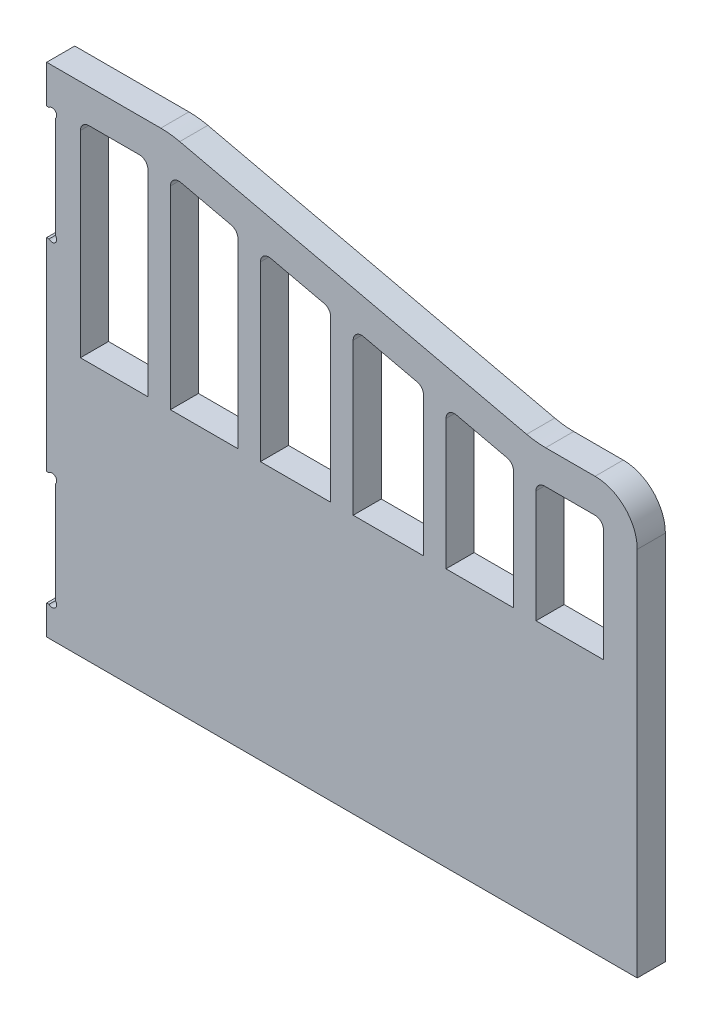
ISO-10303-21;
HEADER;
FILE_DESCRIPTION(('STEP AP214'),'2;1');
FILE_NAME('part.step','',(''),(''),'','','');
FILE_SCHEMA(('AUTOMOTIVE_DESIGN { 1 0 10303 214 1 1 1 1 }'));
ENDSEC;
DATA;
#1=APPLICATION_CONTEXT('core data for automotive mechanical design processes');
#2=APPLICATION_PROTOCOL_DEFINITION('international standard','automotive_design',2000,#1);
#3=PRODUCT_CONTEXT('',#1,'mechanical');
#4=PRODUCT('Part','Part','',(#3));
#5=PRODUCT_RELATED_PRODUCT_CATEGORY('part','',(#4));
#6=PRODUCT_DEFINITION_FORMATION('','',#4);
#7=PRODUCT_DEFINITION_CONTEXT('part definition',#1,'design');
#8=PRODUCT_DEFINITION('design','',#6,#7);
#9=PRODUCT_DEFINITION_SHAPE('','',#8);
#10=(LENGTH_UNIT() NAMED_UNIT(*) SI_UNIT(.MILLI.,.METRE.));
#11=(NAMED_UNIT(*) PLANE_ANGLE_UNIT() SI_UNIT($,.RADIAN.));
#12=(NAMED_UNIT(*) SI_UNIT($,.STERADIAN.) SOLID_ANGLE_UNIT());
#13=UNCERTAINTY_MEASURE_WITH_UNIT(LENGTH_MEASURE(1.E-05),#10,'distance_accuracy_value','');
#14=(GEOMETRIC_REPRESENTATION_CONTEXT(3) GLOBAL_UNCERTAINTY_ASSIGNED_CONTEXT((#13)) GLOBAL_UNIT_ASSIGNED_CONTEXT((#10,
#11,#12)) REPRESENTATION_CONTEXT('',''));
#15=CARTESIAN_POINT('',(0.,0.,0.));
#16=DIRECTION('',(0.,0.,1.));
#17=DIRECTION('',(1.,0.,0.));
#18=AXIS2_PLACEMENT_3D('',#15,#16,#17);
#19=CARTESIAN_POINT('',(1.96862915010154,127.131370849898,10.));
#20=DIRECTION('',(0.,0.,1.));
#21=DIRECTION('',(1.,0.,0.));
#22=AXIS2_PLACEMENT_3D('',#19,#20,#21);
#23=PLANE('',#22);
#24=DIRECTION('',(0.,1.,0.));
#25=VECTOR('',#24,1.);
#26=CARTESIAN_POINT('',(134.,144.528849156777,10.));
#27=LINE('',#26,#25);
#28=CARTESIAN_POINT('',(134.,95.,10.));
#29=VERTEX_POINT('',#28);
#30=CARTESIAN_POINT('',(134.,144.528849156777,10.));
#31=VERTEX_POINT('',#30);
#32=EDGE_CURVE('E540',#29,#31,#27,.T.);
#33=ORIENTED_EDGE('',*,*,#32,.F.);
#34=DIRECTION('',(1.,0.,0.));
#35=VECTOR('',#34,1.);
#36=CARTESIAN_POINT('',(134.,95.,10.));
#37=LINE('',#36,#35);
#38=CARTESIAN_POINT('',(109.,95.,10.));
#39=VERTEX_POINT('',#38);
#40=EDGE_CURVE('E538',#39,#29,#37,.T.);
#41=ORIENTED_EDGE('',*,*,#40,.F.);
#42=DIRECTION('',(0.,-1.,0.));
#43=VECTOR('',#42,1.);
#44=CARTESIAN_POINT('',(109.,95.,10.));
#45=LINE('',#44,#43);
#46=CARTESIAN_POINT('',(109.,148.913464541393,10.));
#47=VERTEX_POINT('',#46);
#48=EDGE_CURVE('E550',#47,#39,#45,.T.);
#49=ORIENTED_EDGE('',*,*,#48,.F.);
#50=CARTESIAN_POINT('',(112.,148.913464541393,10.));
#51=DIRECTION('',(0.,0.,1.));
#52=DIRECTION('',(1.,0.,0.));
#53=AXIS2_PLACEMENT_3D('',#50,#51,#52);
#54=CIRCLE('',#53,3.00000000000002);
#55=CARTESIAN_POINT('',(112.674578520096,151.836638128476,10.));
#56=VERTEX_POINT('',#55);
#57=EDGE_CURVE('E547',#56,#47,#54,.T.);
#58=ORIENTED_EDGE('',*,*,#57,.F.);
#59=DIRECTION('',(-0.97439119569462,0.22485950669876,0.));
#60=VECTOR('',#59,1.);
#61=CARTESIAN_POINT('',(112.674578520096,151.836638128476,10.));
#62=LINE('',#61,#60);
#63=CARTESIAN_POINT('',(131.674578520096,147.452022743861,10.));
#64=VERTEX_POINT('',#63);
#65=EDGE_CURVE('E545',#64,#56,#62,.T.);
#66=ORIENTED_EDGE('',*,*,#65,.F.);
#67=CARTESIAN_POINT('',(131.,144.528849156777,10.));
#68=DIRECTION('',(0.,0.,1.));
#69=DIRECTION('',(-1.,0.,0.));
#70=AXIS2_PLACEMENT_3D('',#67,#68,#69);
#71=CIRCLE('',#70,2.99999999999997);
#72=EDGE_CURVE('E543',#31,#64,#71,.T.);
#73=ORIENTED_EDGE('',*,*,#72,.F.);
#74=EDGE_LOOP('',(#33,#41,#49,#58,#66,#73));
#75=FACE_BOUND('',#74,.T.);
#76=DIRECTION('',(0.,1.,0.));
#77=VECTOR('',#76,1.);
#78=CARTESIAN_POINT('',(68.,95.,10.));
#79=LINE('',#78,#77);
#80=CARTESIAN_POINT('',(68.,95.,10.));
#81=VERTEX_POINT('',#80);
#82=CARTESIAN_POINT('',(68.,159.759618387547,10.));
#83=VERTEX_POINT('',#82);
#84=EDGE_CURVE('E630',#81,#83,#79,.T.);
#85=ORIENTED_EDGE('',*,*,#84,.F.);
#86=DIRECTION('',(1.,0.,0.));
#87=VECTOR('',#86,1.);
#88=CARTESIAN_POINT('',(44.,95.,10.));
#89=LINE('',#88,#87);
#90=CARTESIAN_POINT('',(44.,95.,10.));
#91=VERTEX_POINT('',#90);
#92=EDGE_CURVE('E628',#91,#81,#89,.T.);
#93=ORIENTED_EDGE('',*,*,#92,.F.);
#94=DIRECTION('',(0.,-1.,0.));
#95=VECTOR('',#94,1.);
#96=CARTESIAN_POINT('',(44.,163.913464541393,10.));
#97=LINE('',#96,#95);
#98=CARTESIAN_POINT('',(44.,163.913464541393,10.));
#99=VERTEX_POINT('',#98);
#100=EDGE_CURVE('E640',#99,#91,#97,.T.);
#101=ORIENTED_EDGE('',*,*,#100,.F.);
#102=CARTESIAN_POINT('',(47.,163.913464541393,10.));
#103=DIRECTION('',(0.,0.,1.));
#104=DIRECTION('',(-1.,0.,0.));
#105=AXIS2_PLACEMENT_3D('',#102,#103,#104);
#106=CIRCLE('',#105,3.);
#107=CARTESIAN_POINT('',(47.6745785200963,166.836638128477,10.));
#108=VERTEX_POINT('',#107);
#109=EDGE_CURVE('E637',#108,#99,#106,.T.);
#110=ORIENTED_EDGE('',*,*,#109,.F.);
#111=DIRECTION('',(-0.97439119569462,0.224859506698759,0.));
#112=VECTOR('',#111,1.);
#113=CARTESIAN_POINT('',(65.6745785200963,162.68279197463,10.));
#114=LINE('',#113,#112);
#115=CARTESIAN_POINT('',(65.6745785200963,162.68279197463,10.));
#116=VERTEX_POINT('',#115);
#117=EDGE_CURVE('E635',#116,#108,#114,.T.);
#118=ORIENTED_EDGE('',*,*,#117,.F.);
#119=CARTESIAN_POINT('',(65.,159.759618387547,10.));
#120=DIRECTION('',(0.,0.,1.));
#121=DIRECTION('',(1.,0.,0.));
#122=AXIS2_PLACEMENT_3D('',#119,#120,#121);
#123=CIRCLE('',#122,3.);
#124=EDGE_CURVE('E633',#83,#116,#123,.T.);
#125=ORIENTED_EDGE('',*,*,#124,.F.);
#126=EDGE_LOOP('',(#85,#93,#101,#110,#118,#125));
#127=FACE_BOUND('',#126,.T.);
#128=DIRECTION('',(1.,0.,0.));
#129=VECTOR('',#128,1.);
#130=CARTESIAN_POINT('',(12.,95.,10.));
#131=LINE('',#130,#129);
#132=CARTESIAN_POINT('',(12.,95.,10.));
#133=VERTEX_POINT('',#132);
#134=CARTESIAN_POINT('',(36.,95.,10.));
#135=VERTEX_POINT('',#134);
#136=EDGE_CURVE('E720',#133,#135,#131,.T.);
#137=ORIENTED_EDGE('',*,*,#136,.F.);
#138=DIRECTION('',(0.,-1.,0.));
#139=VECTOR('',#138,1.);
#140=CARTESIAN_POINT('',(12.,95.,10.));
#141=LINE('',#140,#139);
#142=CARTESIAN_POINT('',(12.,165.,10.));
#143=VERTEX_POINT('',#142);
#144=EDGE_CURVE('E718',#143,#133,#141,.T.);
#145=ORIENTED_EDGE('',*,*,#144,.F.);
#146=CARTESIAN_POINT('',(15.,165.,10.));
#147=DIRECTION('',(0.,0.,1.));
#148=DIRECTION('',(-1.,0.,0.));
#149=AXIS2_PLACEMENT_3D('',#146,#147,#148);
#150=CIRCLE('',#149,3.);
#151=CARTESIAN_POINT('',(15.,168.,10.));
#152=VERTEX_POINT('',#151);
#153=EDGE_CURVE('E730',#152,#143,#150,.T.);
#154=ORIENTED_EDGE('',*,*,#153,.F.);
#155=DIRECTION('',(-1.,0.,0.));
#156=VECTOR('',#155,1.);
#157=CARTESIAN_POINT('',(15.,168.,10.));
#158=LINE('',#157,#156);
#159=CARTESIAN_POINT('',(33.,168.,10.));
#160=VERTEX_POINT('',#159);
#161=EDGE_CURVE('E727',#160,#152,#158,.T.);
#162=ORIENTED_EDGE('',*,*,#161,.F.);
#163=CARTESIAN_POINT('',(33.,165.,10.));
#164=DIRECTION('',(0.,0.,1.));
#165=DIRECTION('',(-1.,0.,0.));
#166=AXIS2_PLACEMENT_3D('',#163,#164,#165);
#167=CIRCLE('',#166,3.);
#168=CARTESIAN_POINT('',(36.,165.,10.));
#169=VERTEX_POINT('',#168);
#170=EDGE_CURVE('E725',#169,#160,#167,.T.);
#171=ORIENTED_EDGE('',*,*,#170,.F.);
#172=DIRECTION('',(0.,1.,0.));
#173=VECTOR('',#172,1.);
#174=CARTESIAN_POINT('',(36.,95.,10.));
#175=LINE('',#174,#173);
#176=EDGE_CURVE('E723',#135,#169,#175,.T.);
#177=ORIENTED_EDGE('',*,*,#176,.F.);
#178=EDGE_LOOP('',(#137,#145,#154,#162,#171,#177));
#179=FACE_BOUND('',#178,.T.);
#180=CARTESIAN_POINT('',(1.96862915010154,127.131370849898,10.));
#181=DIRECTION('',(0.,0.,-1.));
#182=DIRECTION('',(1.,0.,0.));
#183=AXIS2_PLACEMENT_3D('',#180,#181,#182);
#184=CIRCLE('',#183,1.59999999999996);
#185=CARTESIAN_POINT('',(3.1,128.262741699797,10.));
#186=VERTEX_POINT('',#185);
#187=CARTESIAN_POINT('',(0.837258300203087,126.,10.));
#188=VERTEX_POINT('',#187);
#189=EDGE_CURVE('E763',#186,#188,#184,.T.);
#190=ORIENTED_EDGE('',*,*,#189,.T.);
#191=DIRECTION('',(-1.,0.,0.));
#192=VECTOR('',#191,1.);
#193=CARTESIAN_POINT('',(0.837258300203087,126.,10.));
#194=LINE('',#193,#192);
#195=CARTESIAN_POINT('',(0.,126.,10.));
#196=VERTEX_POINT('',#195);
#197=EDGE_CURVE('E766',#188,#196,#194,.T.);
#198=ORIENTED_EDGE('',*,*,#197,.T.);
#199=DIRECTION('',(0.,-1.,0.));
#200=VECTOR('',#199,1.);
#201=CARTESIAN_POINT('',(0.,126.,10.));
#202=LINE('',#201,#200);
#203=CARTESIAN_POINT('',(0.,54.,10.));
#204=VERTEX_POINT('',#203);
#205=EDGE_CURVE('E769',#196,#204,#202,.T.);
#206=ORIENTED_EDGE('',*,*,#205,.T.);
#207=DIRECTION('',(1.,0.,0.));
#208=VECTOR('',#207,1.);
#209=CARTESIAN_POINT('',(0.837258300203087,54.,10.));
#210=LINE('',#209,#208);
#211=CARTESIAN_POINT('',(0.837258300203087,54.,10.));
#212=VERTEX_POINT('',#211);
#213=EDGE_CURVE('E771',#204,#212,#210,.T.);
#214=ORIENTED_EDGE('',*,*,#213,.T.);
#215=CARTESIAN_POINT('',(1.96862915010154,52.8686291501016,10.));
#216=DIRECTION('',(0.,0.,-1.));
#217=DIRECTION('',(-1.,0.,0.));
#218=AXIS2_PLACEMENT_3D('',#215,#216,#217);
#219=CIRCLE('',#218,1.59999999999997);
#220=CARTESIAN_POINT('',(3.1,51.7372583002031,10.));
#221=VERTEX_POINT('',#220);
#222=EDGE_CURVE('E773',#212,#221,#219,.T.);
#223=ORIENTED_EDGE('',*,*,#222,.T.);
#224=DIRECTION('',(0.,-1.,0.));
#225=VECTOR('',#224,1.);
#226=CARTESIAN_POINT('',(3.1,15.7627416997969,10.));
#227=LINE('',#226,#225);
#228=CARTESIAN_POINT('',(3.1,15.7627416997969,10.));
#229=VERTEX_POINT('',#228);
#230=EDGE_CURVE('E775',#221,#229,#227,.T.);
#231=ORIENTED_EDGE('',*,*,#230,.T.);
#232=CARTESIAN_POINT('',(1.96862915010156,14.6313708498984,10.));
#233=DIRECTION('',(0.,0.,-1.));
#234=DIRECTION('',(1.,0.,0.));
#235=AXIS2_PLACEMENT_3D('',#232,#233,#234);
#236=CIRCLE('',#235,1.59999999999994);
#237=CARTESIAN_POINT('',(0.83725830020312,13.5,10.));
#238=VERTEX_POINT('',#237);
#239=EDGE_CURVE('E777',#229,#238,#236,.T.);
#240=ORIENTED_EDGE('',*,*,#239,.T.);
#241=DIRECTION('',(-1.,0.,0.));
#242=VECTOR('',#241,1.);
#243=CARTESIAN_POINT('',(0.83725830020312,13.5,10.));
#244=LINE('',#243,#242);
#245=CARTESIAN_POINT('',(0.,13.5,10.));
#246=VERTEX_POINT('',#245);
#247=EDGE_CURVE('E779',#238,#246,#244,.T.);
#248=ORIENTED_EDGE('',*,*,#247,.T.);
#249=DIRECTION('',(0.,-1.,0.));
#250=VECTOR('',#249,1.);
#251=CARTESIAN_POINT('',(0.,13.5,10.));
#252=LINE('',#251,#250);
#253=CARTESIAN_POINT('',(0.,3.,10.));
#254=VERTEX_POINT('',#253);
#255=EDGE_CURVE('E781',#246,#254,#252,.T.);
#256=ORIENTED_EDGE('',*,*,#255,.T.);
#257=DIRECTION('',(1.,0.,0.));
#258=VECTOR('',#257,1.);
#259=CARTESIAN_POINT('',(0.,3.,10.));
#260=LINE('',#259,#258);
#261=CARTESIAN_POINT('',(210.,3.,10.));
#262=VERTEX_POINT('',#261);
#263=EDGE_CURVE('E783',#254,#262,#260,.T.);
#264=ORIENTED_EDGE('',*,*,#263,.T.);
#265=DIRECTION('',(0.,1.,0.));
#266=VECTOR('',#265,1.);
#267=CARTESIAN_POINT('',(210.,3.,10.));
#268=LINE('',#267,#266);
#269=CARTESIAN_POINT('',(210.,135.,10.));
#270=VERTEX_POINT('',#269);
#271=EDGE_CURVE('E785',#262,#270,#268,.T.);
#272=ORIENTED_EDGE('',*,*,#271,.T.);
#273=CARTESIAN_POINT('',(195.,135.,10.));
#274=DIRECTION('',(0.,0.,1.));
#275=DIRECTION('',(-1.,0.,0.));
#276=AXIS2_PLACEMENT_3D('',#273,#274,#275);
#277=CIRCLE('',#276,15.);
#278=CARTESIAN_POINT('',(195.,150.,10.));
#279=VERTEX_POINT('',#278);
#280=EDGE_CURVE('E787',#270,#279,#277,.T.);
#281=ORIENTED_EDGE('',*,*,#280,.T.);
#282=DIRECTION('',(-1.,0.,0.));
#283=VECTOR('',#282,1.);
#284=CARTESIAN_POINT('',(177.416640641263,150.,10.));
#285=LINE('',#284,#283);
#286=CARTESIAN_POINT('',(177.416640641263,150.,10.));
#287=VERTEX_POINT('',#286);
#288=EDGE_CURVE('E789',#279,#287,#285,.T.);
#289=ORIENTED_EDGE('',*,*,#288,.T.);
#290=CARTESIAN_POINT('',(177.416640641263,180.,10.));
#291=DIRECTION('',(0.,0.,-1.));
#292=DIRECTION('',(1.,0.,0.));
#293=AXIS2_PLACEMENT_3D('',#290,#291,#292);
#294=CIRCLE('',#293,30.);
#295=CARTESIAN_POINT('',(170.6708554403,150.768264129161,10.));
#296=VERTEX_POINT('',#295);
#297=EDGE_CURVE('E791',#287,#296,#294,.T.);
#298=ORIENTED_EDGE('',*,*,#297,.T.);
#299=DIRECTION('',(-0.97439119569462,0.224859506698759,0.));
#300=VECTOR('',#299,1.);
#301=CARTESIAN_POINT('',(170.6708554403,150.768264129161,10.));
#302=LINE('',#301,#300);
#303=CARTESIAN_POINT('',(47.3291445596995,179.231735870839,10.));
#304=VERTEX_POINT('',#303);
#305=EDGE_CURVE('E793',#296,#304,#302,.T.);
#306=ORIENTED_EDGE('',*,*,#305,.T.);
#307=CARTESIAN_POINT('',(40.5833593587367,150.,10.));
#308=DIRECTION('',(0.,0.,1.));
#309=DIRECTION('',(1.,0.,0.));
#310=AXIS2_PLACEMENT_3D('',#307,#308,#309);
#311=CIRCLE('',#310,30.);
#312=CARTESIAN_POINT('',(40.5833593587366,180.,10.));
#313=VERTEX_POINT('',#312);
#314=EDGE_CURVE('E795',#304,#313,#311,.T.);
#315=ORIENTED_EDGE('',*,*,#314,.T.);
#316=DIRECTION('',(-1.,0.,0.));
#317=VECTOR('',#316,1.);
#318=CARTESIAN_POINT('',(40.5833593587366,180.,10.));
#319=LINE('',#318,#317);
#320=CARTESIAN_POINT('',(0.,180.,10.));
#321=VERTEX_POINT('',#320);
#322=EDGE_CURVE('E797',#313,#321,#319,.T.);
#323=ORIENTED_EDGE('',*,*,#322,.T.);
#324=DIRECTION('',(0.,-1.,0.));
#325=VECTOR('',#324,1.);
#326=CARTESIAN_POINT('',(0.,180.,10.));
#327=LINE('',#326,#325);
#328=CARTESIAN_POINT('',(0.,166.5,10.));
#329=VERTEX_POINT('',#328);
#330=EDGE_CURVE('E799',#321,#329,#327,.T.);
#331=ORIENTED_EDGE('',*,*,#330,.T.);
#332=DIRECTION('',(1.,0.,0.));
#333=VECTOR('',#332,1.);
#334=CARTESIAN_POINT('',(0.837258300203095,166.5,10.));
#335=LINE('',#334,#333);
#336=CARTESIAN_POINT('',(0.837258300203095,166.5,10.));
#337=VERTEX_POINT('',#336);
#338=EDGE_CURVE('E801',#329,#337,#335,.T.);
#339=ORIENTED_EDGE('',*,*,#338,.T.);
#340=CARTESIAN_POINT('',(1.96862915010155,165.368629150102,10.));
#341=DIRECTION('',(0.,0.,-1.));
#342=DIRECTION('',(-1.,0.,0.));
#343=AXIS2_PLACEMENT_3D('',#340,#341,#342);
#344=CIRCLE('',#343,1.59999999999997);
#345=CARTESIAN_POINT('',(3.1,164.237258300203,10.));
#346=VERTEX_POINT('',#345);
#347=EDGE_CURVE('E803',#337,#346,#344,.T.);
#348=ORIENTED_EDGE('',*,*,#347,.T.);
#349=DIRECTION('',(0.,-1.,0.));
#350=VECTOR('',#349,1.);
#351=CARTESIAN_POINT('',(3.1,164.237258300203,10.));
#352=LINE('',#351,#350);
#353=EDGE_CURVE('E805',#346,#186,#352,.T.);
#354=ORIENTED_EDGE('',*,*,#353,.T.);
#355=EDGE_LOOP('',(#190,#198,#206,#214,#223,#231,#240,#248,#256,#264,#272,#281,#289,#298,#306,
#315,#323,#331,#339,#348,#354));
#356=FACE_BOUND('',#355,.T.);
#357=DIRECTION('',(1.,0.,0.));
#358=VECTOR('',#357,1.);
#359=CARTESIAN_POINT('',(174.,95.,10.));
#360=LINE('',#359,#358);
#361=CARTESIAN_POINT('',(174.,95.,10.));
#362=VERTEX_POINT('',#361);
#363=CARTESIAN_POINT('',(198.,95.,10.));
#364=VERTEX_POINT('',#363);
#365=EDGE_CURVE('E675',#362,#364,#360,.T.);
#366=ORIENTED_EDGE('',*,*,#365,.F.);
#367=DIRECTION('',(0.,-1.,0.));
#368=VECTOR('',#367,1.);
#369=CARTESIAN_POINT('',(174.,95.,10.));
#370=LINE('',#369,#368);
#371=CARTESIAN_POINT('',(174.,135.,10.));
#372=VERTEX_POINT('',#371);
#373=EDGE_CURVE('E673',#372,#362,#370,.T.);
#374=ORIENTED_EDGE('',*,*,#373,.F.);
#375=CARTESIAN_POINT('',(177.,135.,10.));
#376=DIRECTION('',(0.,0.,1.));
#377=DIRECTION('',(-1.,0.,0.));
#378=AXIS2_PLACEMENT_3D('',#375,#376,#377);
#379=CIRCLE('',#378,3.);
#380=CARTESIAN_POINT('',(177.,138.,10.));
#381=VERTEX_POINT('',#380);
#382=EDGE_CURVE('E685',#381,#372,#379,.T.);
#383=ORIENTED_EDGE('',*,*,#382,.F.);
#384=DIRECTION('',(-1.,0.,0.));
#385=VECTOR('',#384,1.);
#386=CARTESIAN_POINT('',(177.,138.,10.));
#387=LINE('',#386,#385);
#388=CARTESIAN_POINT('',(195.,138.,10.));
#389=VERTEX_POINT('',#388);
#390=EDGE_CURVE('E682',#389,#381,#387,.T.);
#391=ORIENTED_EDGE('',*,*,#390,.F.);
#392=CARTESIAN_POINT('',(195.,135.,10.));
#393=DIRECTION('',(0.,0.,1.));
#394=DIRECTION('',(-1.,0.,0.));
#395=AXIS2_PLACEMENT_3D('',#392,#393,#394);
#396=CIRCLE('',#395,3.);
#397=CARTESIAN_POINT('',(198.,135.,10.));
#398=VERTEX_POINT('',#397);
#399=EDGE_CURVE('E680',#398,#389,#396,.T.);
#400=ORIENTED_EDGE('',*,*,#399,.F.);
#401=DIRECTION('',(0.,1.,0.));
#402=VECTOR('',#401,1.);
#403=CARTESIAN_POINT('',(198.,95.,10.));
#404=LINE('',#403,#402);
#405=EDGE_CURVE('E678',#364,#398,#404,.T.);
#406=ORIENTED_EDGE('',*,*,#405,.F.);
#407=EDGE_LOOP('',(#366,#374,#383,#391,#400,#406));
#408=FACE_BOUND('',#407,.T.);
#409=DIRECTION('',(0.,1.,0.));
#410=VECTOR('',#409,1.);
#411=CARTESIAN_POINT('',(101.,95.,10.));
#412=LINE('',#411,#410);
#413=CARTESIAN_POINT('',(101.,95.,10.));
#414=VERTEX_POINT('',#413);
#415=CARTESIAN_POINT('',(101.,152.144233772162,10.));
#416=VERTEX_POINT('',#415);
#417=EDGE_CURVE('E585',#414,#416,#412,.T.);
#418=ORIENTED_EDGE('',*,*,#417,.F.);
#419=DIRECTION('',(1.,0.,0.));
#420=VECTOR('',#419,1.);
#421=CARTESIAN_POINT('',(76.,95.,10.));
#422=LINE('',#421,#420);
#423=CARTESIAN_POINT('',(76.,95.,10.));
#424=VERTEX_POINT('',#423);
#425=EDGE_CURVE('E583',#424,#414,#422,.T.);
#426=ORIENTED_EDGE('',*,*,#425,.F.);
#427=DIRECTION('',(0.,-1.,0.));
#428=VECTOR('',#427,1.);
#429=CARTESIAN_POINT('',(76.,156.528849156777,10.));
#430=LINE('',#429,#428);
#431=CARTESIAN_POINT('',(76.,156.528849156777,10.));
#432=VERTEX_POINT('',#431);
#433=EDGE_CURVE('E595',#432,#424,#430,.T.);
#434=ORIENTED_EDGE('',*,*,#433,.F.);
#435=CARTESIAN_POINT('',(79.,156.528849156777,10.));
#436=DIRECTION('',(0.,0.,1.));
#437=DIRECTION('',(-1.,0.,0.));
#438=AXIS2_PLACEMENT_3D('',#435,#436,#437);
#439=CIRCLE('',#438,2.99999999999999);
#440=CARTESIAN_POINT('',(79.6745785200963,159.452022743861,10.));
#441=VERTEX_POINT('',#440);
#442=EDGE_CURVE('E592',#441,#432,#439,.T.);
#443=ORIENTED_EDGE('',*,*,#442,.F.);
#444=DIRECTION('',(-0.97439119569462,0.224859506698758,0.));
#445=VECTOR('',#444,1.);
#446=CARTESIAN_POINT('',(98.6745785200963,155.067407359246,10.));
#447=LINE('',#446,#445);
#448=CARTESIAN_POINT('',(98.6745785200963,155.067407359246,10.));
#449=VERTEX_POINT('',#448);
#450=EDGE_CURVE('E590',#449,#441,#447,.T.);
#451=ORIENTED_EDGE('',*,*,#450,.F.);
#452=CARTESIAN_POINT('',(98.,152.144233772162,10.));
#453=DIRECTION('',(0.,0.,1.));
#454=DIRECTION('',(1.,0.,0.));
#455=AXIS2_PLACEMENT_3D('',#452,#453,#454);
#456=CIRCLE('',#455,3.00000000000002);
#457=EDGE_CURVE('E588',#416,#449,#456,.T.);
#458=ORIENTED_EDGE('',*,*,#457,.F.);
#459=EDGE_LOOP('',(#418,#426,#434,#443,#451,#458));
#460=FACE_BOUND('',#459,.T.);
#461=DIRECTION('',(0.,1.,0.));
#462=VECTOR('',#461,1.);
#463=CARTESIAN_POINT('',(166.,95.,10.));
#464=LINE('',#463,#462);
#465=CARTESIAN_POINT('',(166.,95.,10.));
#466=VERTEX_POINT('',#465);
#467=CARTESIAN_POINT('',(166.,137.144233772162,10.));
#468=VERTEX_POINT('',#467);
#469=EDGE_CURVE('E497',#466,#468,#464,.T.);
#470=ORIENTED_EDGE('',*,*,#469,.F.);
#471=DIRECTION('',(1.,0.,0.));
#472=VECTOR('',#471,1.);
#473=CARTESIAN_POINT('',(142.,95.,10.));
#474=LINE('',#473,#472);
#475=CARTESIAN_POINT('',(142.,95.,10.));
#476=VERTEX_POINT('',#475);
#477=EDGE_CURVE('E495',#476,#466,#474,.T.);
#478=ORIENTED_EDGE('',*,*,#477,.F.);
#479=DIRECTION('',(0.,-1.,0.));
#480=VECTOR('',#479,1.);
#481=CARTESIAN_POINT('',(142.,141.298079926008,10.));
#482=LINE('',#481,#480);
#483=CARTESIAN_POINT('',(142.,141.298079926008,10.));
#484=VERTEX_POINT('',#483);
#485=EDGE_CURVE('E506',#484,#476,#482,.T.);
#486=ORIENTED_EDGE('',*,*,#485,.F.);
#487=CARTESIAN_POINT('',(145.,141.298079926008,10.));
#488=DIRECTION('',(0.,0.,1.));
#489=DIRECTION('',(-1.,0.,0.));
#490=AXIS2_PLACEMENT_3D('',#487,#488,#489);
#491=CIRCLE('',#490,3.);
#492=CARTESIAN_POINT('',(145.674578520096,144.221253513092,10.));
#493=VERTEX_POINT('',#492);
#494=EDGE_CURVE('E504',#493,#484,#491,.T.);
#495=ORIENTED_EDGE('',*,*,#494,.F.);
#496=DIRECTION('',(-0.97439119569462,0.224859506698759,0.));
#497=VECTOR('',#496,1.);
#498=CARTESIAN_POINT('',(163.674578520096,140.067407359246,10.));
#499=LINE('',#498,#497);
#500=CARTESIAN_POINT('',(163.674578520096,140.067407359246,10.));
#501=VERTEX_POINT('',#500);
#502=EDGE_CURVE('E502',#501,#493,#499,.T.);
#503=ORIENTED_EDGE('',*,*,#502,.F.);
#504=CARTESIAN_POINT('',(163.,137.144233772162,10.));
#505=DIRECTION('',(0.,0.,1.));
#506=DIRECTION('',(1.,0.,0.));
#507=AXIS2_PLACEMENT_3D('',#504,#505,#506);
#508=CIRCLE('',#507,3.);
#509=EDGE_CURVE('E500',#468,#501,#508,.T.);
#510=ORIENTED_EDGE('',*,*,#509,.F.);
#511=EDGE_LOOP('',(#470,#478,#486,#495,#503,#510));
#512=FACE_BOUND('',#511,.T.);
#513=ADVANCED_FACE('F17',(#75,#127,#179,#356,#408,#460,#512),#23,.T.);
#514=CARTESIAN_POINT('',(1.96862915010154,127.131370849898,0.));
#515=DIRECTION('',(0.,0.,1.));
#516=DIRECTION('',(1.,0.,0.));
#517=AXIS2_PLACEMENT_3D('',#514,#515,#516);
#518=PLANE('',#517);
#519=DIRECTION('',(1.,0.,0.));
#520=VECTOR('',#519,1.);
#521=CARTESIAN_POINT('',(57.2627416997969,87.,0.));
#522=LINE('',#521,#520);
#523=CARTESIAN_POINT('',(57.2627416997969,87.,0.));
#524=VERTEX_POINT('',#523);
#525=CARTESIAN_POINT('',(92.7372583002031,87.,0.));
#526=VERTEX_POINT('',#525);
#527=EDGE_CURVE('E465',#524,#526,#522,.T.);
#528=ORIENTED_EDGE('',*,*,#527,.F.);
#529=CARTESIAN_POINT('',(56.1313708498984,85.8686291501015,0.));
#530=DIRECTION('',(0.,0.,-1.));
#531=DIRECTION('',(-1.,0.,0.));
#532=AXIS2_PLACEMENT_3D('',#529,#530,#531);
#533=CIRCLE('',#532,1.59999999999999);
#534=CARTESIAN_POINT('',(55.,84.737258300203,0.));
#535=VERTEX_POINT('',#534);
#536=EDGE_CURVE('E32',#535,#524,#533,.T.);
#537=ORIENTED_EDGE('',*,*,#536,.F.);
#538=DIRECTION('',(0.,1.,0.));
#539=VECTOR('',#538,1.);
#540=CARTESIAN_POINT('',(55.,83.262741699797,0.));
#541=LINE('',#540,#539);
#542=CARTESIAN_POINT('',(55.,83.262741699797,0.));
#543=VERTEX_POINT('',#542);
#544=EDGE_CURVE('E445',#543,#535,#541,.T.);
#545=ORIENTED_EDGE('',*,*,#544,.F.);
#546=CARTESIAN_POINT('',(56.1313708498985,82.1313708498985,0.));
#547=DIRECTION('',(0.,0.,-1.));
#548=DIRECTION('',(1.,0.,0.));
#549=AXIS2_PLACEMENT_3D('',#546,#547,#548);
#550=CIRCLE('',#549,1.59999999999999);
#551=CARTESIAN_POINT('',(57.2627416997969,81.,0.));
#552=VERTEX_POINT('',#551);
#553=EDGE_CURVE('E448',#552,#543,#550,.T.);
#554=ORIENTED_EDGE('',*,*,#553,.F.);
#555=DIRECTION('',(-1.,0.,0.));
#556=VECTOR('',#555,1.);
#557=CARTESIAN_POINT('',(92.7372583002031,81.,0.));
#558=LINE('',#557,#556);
#559=CARTESIAN_POINT('',(92.7372583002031,81.,0.));
#560=VERTEX_POINT('',#559);
#561=EDGE_CURVE('E476',#560,#552,#558,.T.);
#562=ORIENTED_EDGE('',*,*,#561,.F.);
#563=CARTESIAN_POINT('',(93.8686291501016,82.1313708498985,0.));
#564=DIRECTION('',(0.,0.,-1.));
#565=DIRECTION('',(-1.,0.,0.));
#566=AXIS2_PLACEMENT_3D('',#563,#564,#565);
#567=CIRCLE('',#566,1.59999999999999);
#568=CARTESIAN_POINT('',(95.,83.262741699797,0.));
#569=VERTEX_POINT('',#568);
#570=EDGE_CURVE('E473',#569,#560,#567,.T.);
#571=ORIENTED_EDGE('',*,*,#570,.F.);
#572=DIRECTION('',(0.,-1.,0.));
#573=VECTOR('',#572,1.);
#574=CARTESIAN_POINT('',(95.,84.737258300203,0.));
#575=LINE('',#574,#573);
#576=CARTESIAN_POINT('',(95.,84.737258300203,0.));
#577=VERTEX_POINT('',#576);
#578=EDGE_CURVE('E470',#577,#569,#575,.T.);
#579=ORIENTED_EDGE('',*,*,#578,.F.);
#580=CARTESIAN_POINT('',(93.8686291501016,85.8686291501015,0.));
#581=DIRECTION('',(0.,0.,-1.));
#582=DIRECTION('',(1.,0.,0.));
#583=AXIS2_PLACEMENT_3D('',#580,#581,#582);
#584=CIRCLE('',#583,1.59999999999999);
#585=EDGE_CURVE('E467',#526,#577,#584,.T.);
#586=ORIENTED_EDGE('',*,*,#585,.F.);
#587=EDGE_LOOP('',(#528,#537,#545,#554,#562,#571,#579,#586));
#588=FACE_BOUND('',#587,.T.);
#589=DIRECTION('',(1.,0.,0.));
#590=VECTOR('',#589,1.);
#591=CARTESIAN_POINT('',(134.,95.,0.));
#592=LINE('',#591,#590);
#593=CARTESIAN_POINT('',(109.,95.,0.));
#594=VERTEX_POINT('',#593);
#595=CARTESIAN_POINT('',(134.,95.,0.));
#596=VERTEX_POINT('',#595);
#597=EDGE_CURVE('E537',#594,#596,#592,.T.);
#598=ORIENTED_EDGE('',*,*,#597,.T.);
#599=DIRECTION('',(0.,1.,0.));
#600=VECTOR('',#599,1.);
#601=CARTESIAN_POINT('',(134.,144.528849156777,0.));
#602=LINE('',#601,#600);
#603=CARTESIAN_POINT('',(134.,144.528849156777,0.));
#604=VERTEX_POINT('',#603);
#605=EDGE_CURVE('E555',#596,#604,#602,.T.);
#606=ORIENTED_EDGE('',*,*,#605,.T.);
#607=CARTESIAN_POINT('',(131.,144.528849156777,0.));
#608=DIRECTION('',(0.,0.,1.));
#609=DIRECTION('',(-1.,0.,0.));
#610=AXIS2_PLACEMENT_3D('',#607,#608,#609);
#611=CIRCLE('',#610,2.99999999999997);
#612=CARTESIAN_POINT('',(131.674578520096,147.452022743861,0.));
#613=VERTEX_POINT('',#612);
#614=EDGE_CURVE('E558',#604,#613,#611,.T.);
#615=ORIENTED_EDGE('',*,*,#614,.T.);
#616=DIRECTION('',(-0.97439119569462,0.22485950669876,0.));
#617=VECTOR('',#616,1.);
#618=CARTESIAN_POINT('',(112.674578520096,151.836638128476,0.));
#619=LINE('',#618,#617);
#620=CARTESIAN_POINT('',(112.674578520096,151.836638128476,0.));
#621=VERTEX_POINT('',#620);
#622=EDGE_CURVE('E561',#613,#621,#619,.T.);
#623=ORIENTED_EDGE('',*,*,#622,.T.);
#624=CARTESIAN_POINT('',(112.,148.913464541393,0.));
#625=DIRECTION('',(0.,0.,1.));
#626=DIRECTION('',(1.,0.,0.));
#627=AXIS2_PLACEMENT_3D('',#624,#625,#626);
#628=CIRCLE('',#627,3.00000000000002);
#629=CARTESIAN_POINT('',(109.,148.913464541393,0.));
#630=VERTEX_POINT('',#629);
#631=EDGE_CURVE('E564',#621,#630,#628,.T.);
#632=ORIENTED_EDGE('',*,*,#631,.T.);
#633=DIRECTION('',(0.,-1.,0.));
#634=VECTOR('',#633,1.);
#635=CARTESIAN_POINT('',(109.,95.,0.));
#636=LINE('',#635,#634);
#637=EDGE_CURVE('E541',#630,#594,#636,.T.);
#638=ORIENTED_EDGE('',*,*,#637,.T.);
#639=EDGE_LOOP('',(#598,#606,#615,#623,#632,#638));
#640=FACE_BOUND('',#639,.T.);
#641=DIRECTION('',(1.,0.,0.));
#642=VECTOR('',#641,1.);
#643=CARTESIAN_POINT('',(44.,95.,0.));
#644=LINE('',#643,#642);
#645=CARTESIAN_POINT('',(44.,95.,0.));
#646=VERTEX_POINT('',#645);
#647=CARTESIAN_POINT('',(68.,95.,0.));
#648=VERTEX_POINT('',#647);
#649=EDGE_CURVE('E627',#646,#648,#644,.T.);
#650=ORIENTED_EDGE('',*,*,#649,.T.);
#651=DIRECTION('',(0.,1.,0.));
#652=VECTOR('',#651,1.);
#653=CARTESIAN_POINT('',(68.,95.,0.));
#654=LINE('',#653,#652);
#655=CARTESIAN_POINT('',(68.,159.759618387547,0.));
#656=VERTEX_POINT('',#655);
#657=EDGE_CURVE('E645',#648,#656,#654,.T.);
#658=ORIENTED_EDGE('',*,*,#657,.T.);
#659=CARTESIAN_POINT('',(65.,159.759618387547,0.));
#660=DIRECTION('',(0.,0.,1.));
#661=DIRECTION('',(1.,0.,0.));
#662=AXIS2_PLACEMENT_3D('',#659,#660,#661);
#663=CIRCLE('',#662,3.);
#664=CARTESIAN_POINT('',(65.6745785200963,162.68279197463,0.));
#665=VERTEX_POINT('',#664);
#666=EDGE_CURVE('E648',#656,#665,#663,.T.);
#667=ORIENTED_EDGE('',*,*,#666,.T.);
#668=DIRECTION('',(-0.97439119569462,0.224859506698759,0.));
#669=VECTOR('',#668,1.);
#670=CARTESIAN_POINT('',(65.6745785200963,162.68279197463,0.));
#671=LINE('',#670,#669);
#672=CARTESIAN_POINT('',(47.6745785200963,166.836638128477,0.));
#673=VERTEX_POINT('',#672);
#674=EDGE_CURVE('E651',#665,#673,#671,.T.);
#675=ORIENTED_EDGE('',*,*,#674,.T.);
#676=CARTESIAN_POINT('',(47.,163.913464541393,0.));
#677=DIRECTION('',(0.,0.,1.));
#678=DIRECTION('',(-1.,0.,0.));
#679=AXIS2_PLACEMENT_3D('',#676,#677,#678);
#680=CIRCLE('',#679,3.);
#681=CARTESIAN_POINT('',(44.,163.913464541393,0.));
#682=VERTEX_POINT('',#681);
#683=EDGE_CURVE('E654',#673,#682,#680,.T.);
#684=ORIENTED_EDGE('',*,*,#683,.T.);
#685=DIRECTION('',(0.,-1.,0.));
#686=VECTOR('',#685,1.);
#687=CARTESIAN_POINT('',(44.,163.913464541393,0.));
#688=LINE('',#687,#686);
#689=EDGE_CURVE('E631',#682,#646,#688,.T.);
#690=ORIENTED_EDGE('',*,*,#689,.T.);
#691=EDGE_LOOP('',(#650,#658,#667,#675,#684,#690));
#692=FACE_BOUND('',#691,.T.);
#693=DIRECTION('',(0.,-1.,0.));
#694=VECTOR('',#693,1.);
#695=CARTESIAN_POINT('',(12.,95.,0.));
#696=LINE('',#695,#694);
#697=CARTESIAN_POINT('',(12.,165.,0.));
#698=VERTEX_POINT('',#697);
#699=CARTESIAN_POINT('',(12.,95.,0.));
#700=VERTEX_POINT('',#699);
#701=EDGE_CURVE('E717',#698,#700,#696,.T.);
#702=ORIENTED_EDGE('',*,*,#701,.T.);
#703=DIRECTION('',(1.,0.,0.));
#704=VECTOR('',#703,1.);
#705=CARTESIAN_POINT('',(12.,95.,0.));
#706=LINE('',#705,#704);
#707=CARTESIAN_POINT('',(36.,95.,0.));
#708=VERTEX_POINT('',#707);
#709=EDGE_CURVE('E735',#700,#708,#706,.T.);
#710=ORIENTED_EDGE('',*,*,#709,.T.);
#711=DIRECTION('',(0.,1.,0.));
#712=VECTOR('',#711,1.);
#713=CARTESIAN_POINT('',(36.,95.,0.));
#714=LINE('',#713,#712);
#715=CARTESIAN_POINT('',(36.,165.,0.));
#716=VERTEX_POINT('',#715);
#717=EDGE_CURVE('E738',#708,#716,#714,.T.);
#718=ORIENTED_EDGE('',*,*,#717,.T.);
#719=CARTESIAN_POINT('',(33.,165.,0.));
#720=DIRECTION('',(0.,0.,1.));
#721=DIRECTION('',(-1.,0.,0.));
#722=AXIS2_PLACEMENT_3D('',#719,#720,#721);
#723=CIRCLE('',#722,3.);
#724=CARTESIAN_POINT('',(33.,168.,0.));
#725=VERTEX_POINT('',#724);
#726=EDGE_CURVE('E741',#716,#725,#723,.T.);
#727=ORIENTED_EDGE('',*,*,#726,.T.);
#728=DIRECTION('',(-1.,0.,0.));
#729=VECTOR('',#728,1.);
#730=CARTESIAN_POINT('',(15.,168.,0.));
#731=LINE('',#730,#729);
#732=CARTESIAN_POINT('',(15.,168.,0.));
#733=VERTEX_POINT('',#732);
#734=EDGE_CURVE('E744',#725,#733,#731,.T.);
#735=ORIENTED_EDGE('',*,*,#734,.T.);
#736=CARTESIAN_POINT('',(15.,165.,0.));
#737=DIRECTION('',(0.,0.,1.));
#738=DIRECTION('',(-1.,0.,0.));
#739=AXIS2_PLACEMENT_3D('',#736,#737,#738);
#740=CIRCLE('',#739,3.);
#741=EDGE_CURVE('E721',#733,#698,#740,.T.);
#742=ORIENTED_EDGE('',*,*,#741,.T.);
#743=EDGE_LOOP('',(#702,#710,#718,#727,#735,#742));
#744=FACE_BOUND('',#743,.T.);
#745=CARTESIAN_POINT('',(1.96862915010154,127.131370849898,0.));
#746=DIRECTION('',(0.,0.,-1.));
#747=DIRECTION('',(1.,0.,0.));
#748=AXIS2_PLACEMENT_3D('',#745,#746,#747);
#749=CIRCLE('',#748,1.59999999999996);
#750=CARTESIAN_POINT('',(3.1,128.262741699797,0.));
#751=VERTEX_POINT('',#750);
#752=CARTESIAN_POINT('',(0.837258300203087,126.,0.));
#753=VERTEX_POINT('',#752);
#754=EDGE_CURVE('E762',#751,#753,#749,.T.);
#755=ORIENTED_EDGE('',*,*,#754,.F.);
#756=DIRECTION('',(0.,-1.,0.));
#757=VECTOR('',#756,1.);
#758=CARTESIAN_POINT('',(3.1,164.237258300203,0.));
#759=LINE('',#758,#757);
#760=CARTESIAN_POINT('',(3.1,164.237258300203,0.));
#761=VERTEX_POINT('',#760);
#762=EDGE_CURVE('E767',#761,#751,#759,.T.);
#763=ORIENTED_EDGE('',*,*,#762,.F.);
#764=CARTESIAN_POINT('',(1.96862915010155,165.368629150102,0.));
#765=DIRECTION('',(0.,0.,-1.));
#766=DIRECTION('',(-1.,0.,0.));
#767=AXIS2_PLACEMENT_3D('',#764,#765,#766);
#768=CIRCLE('',#767,1.59999999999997);
#769=CARTESIAN_POINT('',(0.837258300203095,166.5,0.));
#770=VERTEX_POINT('',#769);
#771=EDGE_CURVE('E846',#770,#761,#768,.T.);
#772=ORIENTED_EDGE('',*,*,#771,.F.);
#773=DIRECTION('',(1.,0.,0.));
#774=VECTOR('',#773,1.);
#775=CARTESIAN_POINT('',(0.837258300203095,166.5,0.));
#776=LINE('',#775,#774);
#777=CARTESIAN_POINT('',(0.,166.5,0.));
#778=VERTEX_POINT('',#777);
#779=EDGE_CURVE('E844',#778,#770,#776,.T.);
#780=ORIENTED_EDGE('',*,*,#779,.F.);
#781=DIRECTION('',(0.,-1.,0.));
#782=VECTOR('',#781,1.);
#783=CARTESIAN_POINT('',(0.,180.,0.));
#784=LINE('',#783,#782);
#785=CARTESIAN_POINT('',(0.,180.,0.));
#786=VERTEX_POINT('',#785);
#787=EDGE_CURVE('E842',#786,#778,#784,.T.);
#788=ORIENTED_EDGE('',*,*,#787,.F.);
#789=DIRECTION('',(-1.,0.,0.));
#790=VECTOR('',#789,1.);
#791=CARTESIAN_POINT('',(40.5833593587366,180.,0.));
#792=LINE('',#791,#790);
#793=CARTESIAN_POINT('',(40.5833593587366,180.,0.));
#794=VERTEX_POINT('',#793);
#795=EDGE_CURVE('E840',#794,#786,#792,.T.);
#796=ORIENTED_EDGE('',*,*,#795,.F.);
#797=CARTESIAN_POINT('',(40.5833593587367,150.,0.));
#798=DIRECTION('',(0.,0.,1.));
#799=DIRECTION('',(1.,0.,0.));
#800=AXIS2_PLACEMENT_3D('',#797,#798,#799);
#801=CIRCLE('',#800,30.);
#802=CARTESIAN_POINT('',(47.3291445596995,179.231735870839,0.));
#803=VERTEX_POINT('',#802);
#804=EDGE_CURVE('E838',#803,#794,#801,.T.);
#805=ORIENTED_EDGE('',*,*,#804,.F.);
#806=DIRECTION('',(-0.97439119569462,0.224859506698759,0.));
#807=VECTOR('',#806,1.);
#808=CARTESIAN_POINT('',(170.6708554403,150.768264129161,0.));
#809=LINE('',#808,#807);
#810=CARTESIAN_POINT('',(170.6708554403,150.768264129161,0.));
#811=VERTEX_POINT('',#810);
#812=EDGE_CURVE('E836',#811,#803,#809,.T.);
#813=ORIENTED_EDGE('',*,*,#812,.F.);
#814=CARTESIAN_POINT('',(177.416640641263,180.,0.));
#815=DIRECTION('',(0.,0.,-1.));
#816=DIRECTION('',(1.,0.,0.));
#817=AXIS2_PLACEMENT_3D('',#814,#815,#816);
#818=CIRCLE('',#817,30.);
#819=CARTESIAN_POINT('',(177.416640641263,150.,0.));
#820=VERTEX_POINT('',#819);
#821=EDGE_CURVE('E834',#820,#811,#818,.T.);
#822=ORIENTED_EDGE('',*,*,#821,.F.);
#823=DIRECTION('',(-1.,0.,0.));
#824=VECTOR('',#823,1.);
#825=CARTESIAN_POINT('',(177.416640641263,150.,0.));
#826=LINE('',#825,#824);
#827=CARTESIAN_POINT('',(195.,150.,0.));
#828=VERTEX_POINT('',#827);
#829=EDGE_CURVE('E832',#828,#820,#826,.T.);
#830=ORIENTED_EDGE('',*,*,#829,.F.);
#831=CARTESIAN_POINT('',(195.,135.,0.));
#832=DIRECTION('',(0.,0.,1.));
#833=DIRECTION('',(-1.,0.,0.));
#834=AXIS2_PLACEMENT_3D('',#831,#832,#833);
#835=CIRCLE('',#834,15.);
#836=CARTESIAN_POINT('',(210.,135.,0.));
#837=VERTEX_POINT('',#836);
#838=EDGE_CURVE('E830',#837,#828,#835,.T.);
#839=ORIENTED_EDGE('',*,*,#838,.F.);
#840=DIRECTION('',(0.,1.,0.));
#841=VECTOR('',#840,1.);
#842=CARTESIAN_POINT('',(210.,3.,0.));
#843=LINE('',#842,#841);
#844=CARTESIAN_POINT('',(210.,3.,0.));
#845=VERTEX_POINT('',#844);
#846=EDGE_CURVE('E828',#845,#837,#843,.T.);
#847=ORIENTED_EDGE('',*,*,#846,.F.);
#848=DIRECTION('',(1.,0.,0.));
#849=VECTOR('',#848,1.);
#850=CARTESIAN_POINT('',(0.,3.,0.));
#851=LINE('',#850,#849);
#852=CARTESIAN_POINT('',(0.,3.,0.));
#853=VERTEX_POINT('',#852);
#854=EDGE_CURVE('E826',#853,#845,#851,.T.);
#855=ORIENTED_EDGE('',*,*,#854,.F.);
#856=DIRECTION('',(0.,-1.,0.));
#857=VECTOR('',#856,1.);
#858=CARTESIAN_POINT('',(0.,13.5,0.));
#859=LINE('',#858,#857);
#860=CARTESIAN_POINT('',(0.,13.5,0.));
#861=VERTEX_POINT('',#860);
#862=EDGE_CURVE('E824',#861,#853,#859,.T.);
#863=ORIENTED_EDGE('',*,*,#862,.F.);
#864=DIRECTION('',(-1.,0.,0.));
#865=VECTOR('',#864,1.);
#866=CARTESIAN_POINT('',(0.83725830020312,13.5,0.));
#867=LINE('',#866,#865);
#868=CARTESIAN_POINT('',(0.83725830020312,13.5,0.));
#869=VERTEX_POINT('',#868);
#870=EDGE_CURVE('E822',#869,#861,#867,.T.);
#871=ORIENTED_EDGE('',*,*,#870,.F.);
#872=CARTESIAN_POINT('',(1.96862915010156,14.6313708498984,0.));
#873=DIRECTION('',(0.,0.,-1.));
#874=DIRECTION('',(1.,0.,0.));
#875=AXIS2_PLACEMENT_3D('',#872,#873,#874);
#876=CIRCLE('',#875,1.59999999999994);
#877=CARTESIAN_POINT('',(3.1,15.7627416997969,0.));
#878=VERTEX_POINT('',#877);
#879=EDGE_CURVE('E820',#878,#869,#876,.T.);
#880=ORIENTED_EDGE('',*,*,#879,.F.);
#881=DIRECTION('',(0.,-1.,0.));
#882=VECTOR('',#881,1.);
#883=CARTESIAN_POINT('',(3.1,15.7627416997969,0.));
#884=LINE('',#883,#882);
#885=CARTESIAN_POINT('',(3.1,51.7372583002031,0.));
#886=VERTEX_POINT('',#885);
#887=EDGE_CURVE('E818',#886,#878,#884,.T.);
#888=ORIENTED_EDGE('',*,*,#887,.F.);
#889=CARTESIAN_POINT('',(1.96862915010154,52.8686291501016,0.));
#890=DIRECTION('',(0.,0.,-1.));
#891=DIRECTION('',(-1.,0.,0.));
#892=AXIS2_PLACEMENT_3D('',#889,#890,#891);
#893=CIRCLE('',#892,1.59999999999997);
#894=CARTESIAN_POINT('',(0.837258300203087,54.,0.));
#895=VERTEX_POINT('',#894);
#896=EDGE_CURVE('E816',#895,#886,#893,.T.);
#897=ORIENTED_EDGE('',*,*,#896,.F.);
#898=DIRECTION('',(1.,0.,0.));
#899=VECTOR('',#898,1.);
#900=CARTESIAN_POINT('',(0.837258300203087,54.,0.));
#901=LINE('',#900,#899);
#902=CARTESIAN_POINT('',(0.,54.,0.));
#903=VERTEX_POINT('',#902);
#904=EDGE_CURVE('E814',#903,#895,#901,.T.);
#905=ORIENTED_EDGE('',*,*,#904,.F.);
#906=DIRECTION('',(0.,-1.,0.));
#907=VECTOR('',#906,1.);
#908=CARTESIAN_POINT('',(0.,126.,0.));
#909=LINE('',#908,#907);
#910=CARTESIAN_POINT('',(0.,126.,0.));
#911=VERTEX_POINT('',#910);
#912=EDGE_CURVE('E812',#911,#903,#909,.T.);
#913=ORIENTED_EDGE('',*,*,#912,.F.);
#914=DIRECTION('',(-1.,0.,0.));
#915=VECTOR('',#914,1.);
#916=CARTESIAN_POINT('',(0.837258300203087,126.,0.));
#917=LINE('',#916,#915);
#918=EDGE_CURVE('E810',#753,#911,#917,.T.);
#919=ORIENTED_EDGE('',*,*,#918,.F.);
#920=EDGE_LOOP('',(#755,#763,#772,#780,#788,#796,#805,#813,#822,#830,#839,#847,#855,#863,#871,
#880,#888,#897,#905,#913,#919));
#921=FACE_BOUND('',#920,.T.);
#922=DIRECTION('',(0.,-1.,0.));
#923=VECTOR('',#922,1.);
#924=CARTESIAN_POINT('',(174.,95.,0.));
#925=LINE('',#924,#923);
#926=CARTESIAN_POINT('',(174.,135.,0.));
#927=VERTEX_POINT('',#926);
#928=CARTESIAN_POINT('',(174.,95.,0.));
#929=VERTEX_POINT('',#928);
#930=EDGE_CURVE('E672',#927,#929,#925,.T.);
#931=ORIENTED_EDGE('',*,*,#930,.T.);
#932=DIRECTION('',(1.,0.,0.));
#933=VECTOR('',#932,1.);
#934=CARTESIAN_POINT('',(174.,95.,0.));
#935=LINE('',#934,#933);
#936=CARTESIAN_POINT('',(198.,95.,0.));
#937=VERTEX_POINT('',#936);
#938=EDGE_CURVE('E690',#929,#937,#935,.T.);
#939=ORIENTED_EDGE('',*,*,#938,.T.);
#940=DIRECTION('',(0.,1.,0.));
#941=VECTOR('',#940,1.);
#942=CARTESIAN_POINT('',(198.,95.,0.));
#943=LINE('',#942,#941);
#944=CARTESIAN_POINT('',(198.,135.,0.));
#945=VERTEX_POINT('',#944);
#946=EDGE_CURVE('E693',#937,#945,#943,.T.);
#947=ORIENTED_EDGE('',*,*,#946,.T.);
#948=CARTESIAN_POINT('',(195.,135.,0.));
#949=DIRECTION('',(0.,0.,1.));
#950=DIRECTION('',(-1.,0.,0.));
#951=AXIS2_PLACEMENT_3D('',#948,#949,#950);
#952=CIRCLE('',#951,3.);
#953=CARTESIAN_POINT('',(195.,138.,0.));
#954=VERTEX_POINT('',#953);
#955=EDGE_CURVE('E696',#945,#954,#952,.T.);
#956=ORIENTED_EDGE('',*,*,#955,.T.);
#957=DIRECTION('',(-1.,0.,0.));
#958=VECTOR('',#957,1.);
#959=CARTESIAN_POINT('',(177.,138.,0.));
#960=LINE('',#959,#958);
#961=CARTESIAN_POINT('',(177.,138.,0.));
#962=VERTEX_POINT('',#961);
#963=EDGE_CURVE('E699',#954,#962,#960,.T.);
#964=ORIENTED_EDGE('',*,*,#963,.T.);
#965=CARTESIAN_POINT('',(177.,135.,0.));
#966=DIRECTION('',(0.,0.,1.));
#967=DIRECTION('',(-1.,0.,0.));
#968=AXIS2_PLACEMENT_3D('',#965,#966,#967);
#969=CIRCLE('',#968,3.);
#970=EDGE_CURVE('E676',#962,#927,#969,.T.);
#971=ORIENTED_EDGE('',*,*,#970,.T.);
#972=EDGE_LOOP('',(#931,#939,#947,#956,#964,#971));
#973=FACE_BOUND('',#972,.T.);
#974=DIRECTION('',(1.,0.,0.));
#975=VECTOR('',#974,1.);
#976=CARTESIAN_POINT('',(76.,95.,0.));
#977=LINE('',#976,#975);
#978=CARTESIAN_POINT('',(76.,95.,0.));
#979=VERTEX_POINT('',#978);
#980=CARTESIAN_POINT('',(101.,95.,0.));
#981=VERTEX_POINT('',#980);
#982=EDGE_CURVE('E582',#979,#981,#977,.T.);
#983=ORIENTED_EDGE('',*,*,#982,.T.);
#984=DIRECTION('',(0.,1.,0.));
#985=VECTOR('',#984,1.);
#986=CARTESIAN_POINT('',(101.,95.,0.));
#987=LINE('',#986,#985);
#988=CARTESIAN_POINT('',(101.,152.144233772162,0.));
#989=VERTEX_POINT('',#988);
#990=EDGE_CURVE('E600',#981,#989,#987,.T.);
#991=ORIENTED_EDGE('',*,*,#990,.T.);
#992=CARTESIAN_POINT('',(98.,152.144233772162,0.));
#993=DIRECTION('',(0.,0.,1.));
#994=DIRECTION('',(1.,0.,0.));
#995=AXIS2_PLACEMENT_3D('',#992,#993,#994);
#996=CIRCLE('',#995,3.00000000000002);
#997=CARTESIAN_POINT('',(98.6745785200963,155.067407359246,0.));
#998=VERTEX_POINT('',#997);
#999=EDGE_CURVE('E603',#989,#998,#996,.T.);
#1000=ORIENTED_EDGE('',*,*,#999,.T.);
#1001=DIRECTION('',(-0.97439119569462,0.224859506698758,0.));
#1002=VECTOR('',#1001,1.);
#1003=CARTESIAN_POINT('',(98.6745785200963,155.067407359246,0.));
#1004=LINE('',#1003,#1002);
#1005=CARTESIAN_POINT('',(79.6745785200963,159.452022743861,0.));
#1006=VERTEX_POINT('',#1005);
#1007=EDGE_CURVE('E606',#998,#1006,#1004,.T.);
#1008=ORIENTED_EDGE('',*,*,#1007,.T.);
#1009=CARTESIAN_POINT('',(79.,156.528849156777,0.));
#1010=DIRECTION('',(0.,0.,1.));
#1011=DIRECTION('',(-1.,0.,0.));
#1012=AXIS2_PLACEMENT_3D('',#1009,#1010,#1011);
#1013=CIRCLE('',#1012,2.99999999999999);
#1014=CARTESIAN_POINT('',(76.,156.528849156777,0.));
#1015=VERTEX_POINT('',#1014);
#1016=EDGE_CURVE('E609',#1006,#1015,#1013,.T.);
#1017=ORIENTED_EDGE('',*,*,#1016,.T.);
#1018=DIRECTION('',(0.,-1.,0.));
#1019=VECTOR('',#1018,1.);
#1020=CARTESIAN_POINT('',(76.,156.528849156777,0.));
#1021=LINE('',#1020,#1019);
#1022=EDGE_CURVE('E586',#1015,#979,#1021,.T.);
#1023=ORIENTED_EDGE('',*,*,#1022,.T.);
#1024=EDGE_LOOP('',(#983,#991,#1000,#1008,#1017,#1023));
#1025=FACE_BOUND('',#1024,.T.);
#1026=DIRECTION('',(1.,0.,0.));
#1027=VECTOR('',#1026,1.);
#1028=CARTESIAN_POINT('',(142.,95.,0.));
#1029=LINE('',#1028,#1027);
#1030=CARTESIAN_POINT('',(142.,95.,0.));
#1031=VERTEX_POINT('',#1030);
#1032=CARTESIAN_POINT('',(166.,95.,0.));
#1033=VERTEX_POINT('',#1032);
#1034=EDGE_CURVE('E483',#1031,#1033,#1029,.T.);
#1035=ORIENTED_EDGE('',*,*,#1034,.T.);
#1036=DIRECTION('',(0.,1.,0.));
#1037=VECTOR('',#1036,1.);
#1038=CARTESIAN_POINT('',(166.,95.,0.));
#1039=LINE('',#1038,#1037);
#1040=CARTESIAN_POINT('',(166.,137.144233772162,0.));
#1041=VERTEX_POINT('',#1040);
#1042=EDGE_CURVE('E511',#1033,#1041,#1039,.T.);
#1043=ORIENTED_EDGE('',*,*,#1042,.T.);
#1044=CARTESIAN_POINT('',(163.,137.144233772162,0.));
#1045=DIRECTION('',(0.,0.,1.));
#1046=DIRECTION('',(1.,0.,0.));
#1047=AXIS2_PLACEMENT_3D('',#1044,#1045,#1046);
#1048=CIRCLE('',#1047,3.);
#1049=CARTESIAN_POINT('',(163.674578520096,140.067407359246,0.));
#1050=VERTEX_POINT('',#1049);
#1051=EDGE_CURVE('E514',#1041,#1050,#1048,.T.);
#1052=ORIENTED_EDGE('',*,*,#1051,.T.);
#1053=DIRECTION('',(-0.97439119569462,0.224859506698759,0.));
#1054=VECTOR('',#1053,1.);
#1055=CARTESIAN_POINT('',(163.674578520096,140.067407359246,0.));
#1056=LINE('',#1055,#1054);
#1057=CARTESIAN_POINT('',(145.674578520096,144.221253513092,0.));
#1058=VERTEX_POINT('',#1057);
#1059=EDGE_CURVE('E517',#1050,#1058,#1056,.T.);
#1060=ORIENTED_EDGE('',*,*,#1059,.T.);
#1061=CARTESIAN_POINT('',(145.,141.298079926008,0.));
#1062=DIRECTION('',(0.,0.,1.));
#1063=DIRECTION('',(-1.,0.,0.));
#1064=AXIS2_PLACEMENT_3D('',#1061,#1062,#1063);
#1065=CIRCLE('',#1064,3.);
#1066=CARTESIAN_POINT('',(142.,141.298079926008,0.));
#1067=VERTEX_POINT('',#1066);
#1068=EDGE_CURVE('E520',#1058,#1067,#1065,.T.);
#1069=ORIENTED_EDGE('',*,*,#1068,.T.);
#1070=DIRECTION('',(0.,-1.,0.));
#1071=VECTOR('',#1070,1.);
#1072=CARTESIAN_POINT('',(142.,141.298079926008,0.));
#1073=LINE('',#1072,#1071);
#1074=EDGE_CURVE('E498',#1067,#1031,#1073,.T.);
#1075=ORIENTED_EDGE('',*,*,#1074,.T.);
#1076=EDGE_LOOP('',(#1035,#1043,#1052,#1060,#1069,#1075));
#1077=FACE_BOUND('',#1076,.T.);
#1078=ADVANCED_FACE('F915',(#588,#640,#692,#744,#921,#973,#1025,#1077),#518,.F.);
#1079=CARTESIAN_POINT('',(1.96862915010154,127.131370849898,10.));
#1080=DIRECTION('',(0.,0.,-1.));
#1081=DIRECTION('',(-1.,0.,0.));
#1082=AXIS2_PLACEMENT_3D('',#1079,#1080,#1081);
#1083=CYLINDRICAL_SURFACE('',#1082,1.59999999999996);
#1084=ORIENTED_EDGE('',*,*,#754,.T.);
#1085=DIRECTION('',(0.,0.,-1.));
#1086=VECTOR('',#1085,1.);
#1087=CARTESIAN_POINT('',(0.837258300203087,126.,10.));
#1088=LINE('',#1087,#1086);
#1089=EDGE_CURVE('E11',#188,#753,#1088,.T.);
#1090=ORIENTED_EDGE('',*,*,#1089,.F.);
#1091=ORIENTED_EDGE('',*,*,#189,.F.);
#1092=DIRECTION('',(0.,0.,-1.));
#1093=VECTOR('',#1092,1.);
#1094=CARTESIAN_POINT('',(3.1,128.262741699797,10.));
#1095=LINE('',#1094,#1093);
#1096=EDGE_CURVE('E807',#186,#751,#1095,.T.);
#1097=ORIENTED_EDGE('',*,*,#1096,.T.);
#1098=EDGE_LOOP('',(#1084,#1090,#1091,#1097));
#1099=FACE_BOUND('',#1098,.T.);
#1100=ADVANCED_FACE('F19',(#1099),#1083,.F.);
#1101=CARTESIAN_POINT('',(0.837258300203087,126.,10.));
#1102=DIRECTION('',(0.,-1.,0.));
#1103=DIRECTION('',(0.,0.,-1.));
#1104=AXIS2_PLACEMENT_3D('',#1101,#1102,#1103);
#1105=PLANE('',#1104);
#1106=ORIENTED_EDGE('',*,*,#918,.T.);
#1107=DIRECTION('',(0.,0.,-1.));
#1108=VECTOR('',#1107,1.);
#1109=CARTESIAN_POINT('',(0.,126.,10.));
#1110=LINE('',#1109,#1108);
#1111=EDGE_CURVE('E25',#196,#911,#1110,.T.);
#1112=ORIENTED_EDGE('',*,*,#1111,.F.);
#1113=ORIENTED_EDGE('',*,*,#197,.F.);
#1114=ORIENTED_EDGE('',*,*,#1089,.T.);
#1115=EDGE_LOOP('',(#1106,#1112,#1113,#1114));
#1116=FACE_BOUND('',#1115,.T.);
#1117=ADVANCED_FACE('F933',(#1116),#1105,.F.);
#1118=CARTESIAN_POINT('',(0.,126.,10.));
#1119=DIRECTION('',(1.,0.,0.));
#1120=DIRECTION('',(0.,0.,-1.));
#1121=AXIS2_PLACEMENT_3D('',#1118,#1119,#1120);
#1122=PLANE('',#1121);
#1123=ORIENTED_EDGE('',*,*,#912,.T.);
#1124=DIRECTION('',(0.,0.,-1.));
#1125=VECTOR('',#1124,1.);
#1126=CARTESIAN_POINT('',(0.,54.,10.));
#1127=LINE('',#1126,#1125);
#1128=EDGE_CURVE('E902',#204,#903,#1127,.T.);
#1129=ORIENTED_EDGE('',*,*,#1128,.F.);
#1130=ORIENTED_EDGE('',*,*,#205,.F.);
#1131=ORIENTED_EDGE('',*,*,#1111,.T.);
#1132=EDGE_LOOP('',(#1123,#1129,#1130,#1131));
#1133=FACE_BOUND('',#1132,.T.);
#1134=ADVANCED_FACE('F909',(#1133),#1122,.F.);
#1135=CARTESIAN_POINT('',(0.837258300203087,54.,10.));
#1136=DIRECTION('',(0.,1.,0.));
#1137=DIRECTION('',(0.,0.,1.));
#1138=AXIS2_PLACEMENT_3D('',#1135,#1136,#1137);
#1139=PLANE('',#1138);
#1140=ORIENTED_EDGE('',*,*,#904,.T.);
#1141=DIRECTION('',(0.,0.,-1.));
#1142=VECTOR('',#1141,1.);
#1143=CARTESIAN_POINT('',(0.837258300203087,54.,10.));
#1144=LINE('',#1143,#1142);
#1145=EDGE_CURVE('E899',#212,#895,#1144,.T.);
#1146=ORIENTED_EDGE('',*,*,#1145,.F.);
#1147=ORIENTED_EDGE('',*,*,#213,.F.);
#1148=ORIENTED_EDGE('',*,*,#1128,.T.);
#1149=EDGE_LOOP('',(#1140,#1146,#1147,#1148));
#1150=FACE_BOUND('',#1149,.T.);
#1151=ADVANCED_FACE('F921',(#1150),#1139,.F.);
#1152=CARTESIAN_POINT('',(1.96862915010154,52.8686291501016,10.));
#1153=DIRECTION('',(0.,0.,-1.));
#1154=DIRECTION('',(-1.,0.,0.));
#1155=AXIS2_PLACEMENT_3D('',#1152,#1153,#1154);
#1156=CYLINDRICAL_SURFACE('',#1155,1.59999999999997);
#1157=ORIENTED_EDGE('',*,*,#896,.T.);
#1158=DIRECTION('',(0.,0.,-1.));
#1159=VECTOR('',#1158,1.);
#1160=CARTESIAN_POINT('',(3.1,51.7372583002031,10.));
#1161=LINE('',#1160,#1159);
#1162=EDGE_CURVE('E896',#221,#886,#1161,.T.);
#1163=ORIENTED_EDGE('',*,*,#1162,.F.);
#1164=ORIENTED_EDGE('',*,*,#222,.F.);
#1165=ORIENTED_EDGE('',*,*,#1145,.T.);
#1166=EDGE_LOOP('',(#1157,#1163,#1164,#1165));
#1167=FACE_BOUND('',#1166,.T.);
#1168=ADVANCED_FACE('F925',(#1167),#1156,.F.);
#1169=CARTESIAN_POINT('',(3.1,15.7627416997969,10.));
#1170=DIRECTION('',(1.,0.,0.));
#1171=DIRECTION('',(0.,1.,0.));
#1172=AXIS2_PLACEMENT_3D('',#1169,#1170,#1171);
#1173=PLANE('',#1172);
#1174=ORIENTED_EDGE('',*,*,#887,.T.);
#1175=DIRECTION('',(0.,0.,-1.));
#1176=VECTOR('',#1175,1.);
#1177=CARTESIAN_POINT('',(3.1,15.7627416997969,10.));
#1178=LINE('',#1177,#1176);
#1179=EDGE_CURVE('E893',#229,#878,#1178,.T.);
#1180=ORIENTED_EDGE('',*,*,#1179,.F.);
#1181=ORIENTED_EDGE('',*,*,#230,.F.);
#1182=ORIENTED_EDGE('',*,*,#1162,.T.);
#1183=EDGE_LOOP('',(#1174,#1180,#1181,#1182));
#1184=FACE_BOUND('',#1183,.T.);
#1185=ADVANCED_FACE('F1011',(#1184),#1173,.F.);
#1186=CARTESIAN_POINT('',(1.96862915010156,14.6313708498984,10.));
#1187=DIRECTION('',(0.,0.,-1.));
#1188=DIRECTION('',(-1.,0.,0.));
#1189=AXIS2_PLACEMENT_3D('',#1186,#1187,#1188);
#1190=CYLINDRICAL_SURFACE('',#1189,1.59999999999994);
#1191=ORIENTED_EDGE('',*,*,#879,.T.);
#1192=DIRECTION('',(0.,0.,-1.));
#1193=VECTOR('',#1192,1.);
#1194=CARTESIAN_POINT('',(0.83725830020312,13.5,10.));
#1195=LINE('',#1194,#1193);
#1196=EDGE_CURVE('E890',#238,#869,#1195,.T.);
#1197=ORIENTED_EDGE('',*,*,#1196,.F.);
#1198=ORIENTED_EDGE('',*,*,#239,.F.);
#1199=ORIENTED_EDGE('',*,*,#1179,.T.);
#1200=EDGE_LOOP('',(#1191,#1197,#1198,#1199));
#1201=FACE_BOUND('',#1200,.T.);
#1202=ADVANCED_FACE('F1009',(#1201),#1190,.F.);
#1203=CARTESIAN_POINT('',(0.83725830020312,13.5,10.));
#1204=DIRECTION('',(0.,-1.,0.));
#1205=DIRECTION('',(1.,0.,0.));
#1206=AXIS2_PLACEMENT_3D('',#1203,#1204,#1205);
#1207=PLANE('',#1206);
#1208=ORIENTED_EDGE('',*,*,#870,.T.);
#1209=DIRECTION('',(0.,0.,-1.));
#1210=VECTOR('',#1209,1.);
#1211=CARTESIAN_POINT('',(0.,13.5,10.));
#1212=LINE('',#1211,#1210);
#1213=EDGE_CURVE('E887',#246,#861,#1212,.T.);
#1214=ORIENTED_EDGE('',*,*,#1213,.F.);
#1215=ORIENTED_EDGE('',*,*,#247,.F.);
#1216=ORIENTED_EDGE('',*,*,#1196,.T.);
#1217=EDGE_LOOP('',(#1208,#1214,#1215,#1216));
#1218=FACE_BOUND('',#1217,.T.);
#1219=ADVANCED_FACE('F1005',(#1218),#1207,.F.);
#1220=CARTESIAN_POINT('',(0.,13.5,10.));
#1221=DIRECTION('',(1.,0.,0.));
#1222=DIRECTION('',(0.,0.,-1.));
#1223=AXIS2_PLACEMENT_3D('',#1220,#1221,#1222);
#1224=PLANE('',#1223);
#1225=ORIENTED_EDGE('',*,*,#862,.T.);
#1226=DIRECTION('',(0.,0.,-1.));
#1227=VECTOR('',#1226,1.);
#1228=CARTESIAN_POINT('',(0.,3.,10.));
#1229=LINE('',#1228,#1227);
#1230=EDGE_CURVE('E884',#254,#853,#1229,.T.);
#1231=ORIENTED_EDGE('',*,*,#1230,.F.);
#1232=ORIENTED_EDGE('',*,*,#255,.F.);
#1233=ORIENTED_EDGE('',*,*,#1213,.T.);
#1234=EDGE_LOOP('',(#1225,#1231,#1232,#1233));
#1235=FACE_BOUND('',#1234,.T.);
#1236=ADVANCED_FACE('F1000',(#1235),#1224,.F.);
#1237=CARTESIAN_POINT('',(0.,3.,10.));
#1238=DIRECTION('',(0.,1.,0.));
#1239=DIRECTION('',(-1.,0.,0.));
#1240=AXIS2_PLACEMENT_3D('',#1237,#1238,#1239);
#1241=PLANE('',#1240);
#1242=ORIENTED_EDGE('',*,*,#854,.T.);
#1243=DIRECTION('',(0.,0.,-1.));
#1244=VECTOR('',#1243,1.);
#1245=CARTESIAN_POINT('',(210.,3.,10.));
#1246=LINE('',#1245,#1244);
#1247=EDGE_CURVE('E881',#262,#845,#1246,.T.);
#1248=ORIENTED_EDGE('',*,*,#1247,.F.);
#1249=ORIENTED_EDGE('',*,*,#263,.F.);
#1250=ORIENTED_EDGE('',*,*,#1230,.T.);
#1251=EDGE_LOOP('',(#1242,#1248,#1249,#1250));
#1252=FACE_BOUND('',#1251,.T.);
#1253=ADVANCED_FACE('F994',(#1252),#1241,.F.);
#1254=CARTESIAN_POINT('',(210.,3.,10.));
#1255=DIRECTION('',(-1.,0.,0.));
#1256=DIRECTION('',(0.,0.,1.));
#1257=AXIS2_PLACEMENT_3D('',#1254,#1255,#1256);
#1258=PLANE('',#1257);
#1259=ORIENTED_EDGE('',*,*,#846,.T.);
#1260=DIRECTION('',(0.,0.,-1.));
#1261=VECTOR('',#1260,1.);
#1262=CARTESIAN_POINT('',(210.,135.,10.));
#1263=LINE('',#1262,#1261);
#1264=EDGE_CURVE('E878',#270,#837,#1263,.T.);
#1265=ORIENTED_EDGE('',*,*,#1264,.F.);
#1266=ORIENTED_EDGE('',*,*,#271,.F.);
#1267=ORIENTED_EDGE('',*,*,#1247,.T.);
#1268=EDGE_LOOP('',(#1259,#1265,#1266,#1267));
#1269=FACE_BOUND('',#1268,.T.);
#1270=ADVANCED_FACE('F990',(#1269),#1258,.F.);
#1271=CARTESIAN_POINT('',(195.,135.,10.));
#1272=DIRECTION('',(0.,0.,-1.));
#1273=DIRECTION('',(-1.,0.,0.));
#1274=AXIS2_PLACEMENT_3D('',#1271,#1272,#1273);
#1275=CYLINDRICAL_SURFACE('',#1274,15.);
#1276=ORIENTED_EDGE('',*,*,#838,.T.);
#1277=DIRECTION('',(0.,0.,-1.));
#1278=VECTOR('',#1277,1.);
#1279=CARTESIAN_POINT('',(195.,150.,10.));
#1280=LINE('',#1279,#1278);
#1281=EDGE_CURVE('E875',#279,#828,#1280,.T.);
#1282=ORIENTED_EDGE('',*,*,#1281,.F.);
#1283=ORIENTED_EDGE('',*,*,#280,.F.);
#1284=ORIENTED_EDGE('',*,*,#1264,.T.);
#1285=EDGE_LOOP('',(#1276,#1282,#1283,#1284));
#1286=FACE_BOUND('',#1285,.T.);
#1287=ADVANCED_FACE('F985',(#1286),#1275,.T.);
#1288=CARTESIAN_POINT('',(177.416640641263,150.,10.));
#1289=DIRECTION('',(0.,-1.,0.));
#1290=DIRECTION('',(0.,0.,-1.));
#1291=AXIS2_PLACEMENT_3D('',#1288,#1289,#1290);
#1292=PLANE('',#1291);
#1293=ORIENTED_EDGE('',*,*,#829,.T.);
#1294=DIRECTION('',(0.,0.,-1.));
#1295=VECTOR('',#1294,1.);
#1296=CARTESIAN_POINT('',(177.416640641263,150.,10.));
#1297=LINE('',#1296,#1295);
#1298=EDGE_CURVE('E872',#287,#820,#1297,.T.);
#1299=ORIENTED_EDGE('',*,*,#1298,.F.);
#1300=ORIENTED_EDGE('',*,*,#288,.F.);
#1301=ORIENTED_EDGE('',*,*,#1281,.T.);
#1302=EDGE_LOOP('',(#1293,#1299,#1300,#1301));
#1303=FACE_BOUND('',#1302,.T.);
#1304=ADVANCED_FACE('F979',(#1303),#1292,.F.);
#1305=CARTESIAN_POINT('',(177.416640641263,180.,10.));
#1306=DIRECTION('',(0.,0.,-1.));
#1307=DIRECTION('',(-1.,0.,0.));
#1308=AXIS2_PLACEMENT_3D('',#1305,#1306,#1307);
#1309=CYLINDRICAL_SURFACE('',#1308,30.);
#1310=ORIENTED_EDGE('',*,*,#821,.T.);
#1311=DIRECTION('',(0.,0.,-1.));
#1312=VECTOR('',#1311,1.);
#1313=CARTESIAN_POINT('',(170.6708554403,150.768264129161,10.));
#1314=LINE('',#1313,#1312);
#1315=EDGE_CURVE('E869',#296,#811,#1314,.T.);
#1316=ORIENTED_EDGE('',*,*,#1315,.F.);
#1317=ORIENTED_EDGE('',*,*,#297,.F.);
#1318=ORIENTED_EDGE('',*,*,#1298,.T.);
#1319=EDGE_LOOP('',(#1310,#1316,#1317,#1318));
#1320=FACE_BOUND('',#1319,.T.);
#1321=ADVANCED_FACE('F975',(#1320),#1309,.F.);
#1322=CARTESIAN_POINT('',(170.6708554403,150.768264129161,10.));
#1323=DIRECTION('',(-0.224859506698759,-0.97439119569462,0.));
#1324=DIRECTION('',(0.97439119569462,-0.224859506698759,0.));
#1325=AXIS2_PLACEMENT_3D('',#1322,#1323,#1324);
#1326=PLANE('',#1325);
#1327=ORIENTED_EDGE('',*,*,#812,.T.);
#1328=DIRECTION('',(0.,0.,-1.));
#1329=VECTOR('',#1328,1.);
#1330=CARTESIAN_POINT('',(47.3291445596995,179.231735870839,10.));
#1331=LINE('',#1330,#1329);
#1332=EDGE_CURVE('E866',#304,#803,#1331,.T.);
#1333=ORIENTED_EDGE('',*,*,#1332,.F.);
#1334=ORIENTED_EDGE('',*,*,#305,.F.);
#1335=ORIENTED_EDGE('',*,*,#1315,.T.);
#1336=EDGE_LOOP('',(#1327,#1333,#1334,#1335));
#1337=FACE_BOUND('',#1336,.T.);
#1338=ADVANCED_FACE('F970',(#1337),#1326,.F.);
#1339=CARTESIAN_POINT('',(40.5833593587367,150.,10.));
#1340=DIRECTION('',(0.,0.,-1.));
#1341=DIRECTION('',(-1.,0.,0.));
#1342=AXIS2_PLACEMENT_3D('',#1339,#1340,#1341);
#1343=CYLINDRICAL_SURFACE('',#1342,30.);
#1344=ORIENTED_EDGE('',*,*,#804,.T.);
#1345=DIRECTION('',(0.,0.,-1.));
#1346=VECTOR('',#1345,1.);
#1347=CARTESIAN_POINT('',(40.5833593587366,180.,10.));
#1348=LINE('',#1347,#1346);
#1349=EDGE_CURVE('E863',#313,#794,#1348,.T.);
#1350=ORIENTED_EDGE('',*,*,#1349,.F.);
#1351=ORIENTED_EDGE('',*,*,#314,.F.);
#1352=ORIENTED_EDGE('',*,*,#1332,.T.);
#1353=EDGE_LOOP('',(#1344,#1350,#1351,#1352));
#1354=FACE_BOUND('',#1353,.T.);
#1355=ADVANCED_FACE('F964',(#1354),#1343,.T.);
#1356=CARTESIAN_POINT('',(40.5833593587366,180.,10.));
#1357=DIRECTION('',(0.,-1.,0.));
#1358=DIRECTION('',(0.,0.,-1.));
#1359=AXIS2_PLACEMENT_3D('',#1356,#1357,#1358);
#1360=PLANE('',#1359);
#1361=ORIENTED_EDGE('',*,*,#795,.T.);
#1362=DIRECTION('',(0.,0.,-1.));
#1363=VECTOR('',#1362,1.);
#1364=CARTESIAN_POINT('',(0.,180.,10.));
#1365=LINE('',#1364,#1363);
#1366=EDGE_CURVE('E860',#321,#786,#1365,.T.);
#1367=ORIENTED_EDGE('',*,*,#1366,.F.);
#1368=ORIENTED_EDGE('',*,*,#322,.F.);
#1369=ORIENTED_EDGE('',*,*,#1349,.T.);
#1370=EDGE_LOOP('',(#1361,#1367,#1368,#1369));
#1371=FACE_BOUND('',#1370,.T.);
#1372=ADVANCED_FACE('F960',(#1371),#1360,.F.);
#1373=CARTESIAN_POINT('',(0.,180.,10.));
#1374=DIRECTION('',(1.,0.,0.));
#1375=DIRECTION('',(0.,0.,-1.));
#1376=AXIS2_PLACEMENT_3D('',#1373,#1374,#1375);
#1377=PLANE('',#1376);
#1378=ORIENTED_EDGE('',*,*,#787,.T.);
#1379=DIRECTION('',(0.,0.,-1.));
#1380=VECTOR('',#1379,1.);
#1381=CARTESIAN_POINT('',(0.,166.5,10.));
#1382=LINE('',#1381,#1380);
#1383=EDGE_CURVE('E857',#329,#778,#1382,.T.);
#1384=ORIENTED_EDGE('',*,*,#1383,.F.);
#1385=ORIENTED_EDGE('',*,*,#330,.F.);
#1386=ORIENTED_EDGE('',*,*,#1366,.T.);
#1387=EDGE_LOOP('',(#1378,#1384,#1385,#1386));
#1388=FACE_BOUND('',#1387,.T.);
#1389=ADVANCED_FACE('F955',(#1388),#1377,.F.);
#1390=CARTESIAN_POINT('',(0.837258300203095,166.5,10.));
#1391=DIRECTION('',(0.,1.,0.));
#1392=DIRECTION('',(0.,0.,1.));
#1393=AXIS2_PLACEMENT_3D('',#1390,#1391,#1392);
#1394=PLANE('',#1393);
#1395=ORIENTED_EDGE('',*,*,#779,.T.);
#1396=DIRECTION('',(0.,0.,-1.));
#1397=VECTOR('',#1396,1.);
#1398=CARTESIAN_POINT('',(0.837258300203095,166.5,10.));
#1399=LINE('',#1398,#1397);
#1400=EDGE_CURVE('E854',#337,#770,#1399,.T.);
#1401=ORIENTED_EDGE('',*,*,#1400,.F.);
#1402=ORIENTED_EDGE('',*,*,#338,.F.);
#1403=ORIENTED_EDGE('',*,*,#1383,.T.);
#1404=EDGE_LOOP('',(#1395,#1401,#1402,#1403));
#1405=FACE_BOUND('',#1404,.T.);
#1406=ADVANCED_FACE('F949',(#1405),#1394,.F.);
#1407=CARTESIAN_POINT('',(1.96862915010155,165.368629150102,10.));
#1408=DIRECTION('',(0.,0.,-1.));
#1409=DIRECTION('',(-1.,0.,0.));
#1410=AXIS2_PLACEMENT_3D('',#1407,#1408,#1409);
#1411=CYLINDRICAL_SURFACE('',#1410,1.59999999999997);
#1412=ORIENTED_EDGE('',*,*,#771,.T.);
#1413=DIRECTION('',(0.,0.,-1.));
#1414=VECTOR('',#1413,1.);
#1415=CARTESIAN_POINT('',(3.1,164.237258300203,10.));
#1416=LINE('',#1415,#1414);
#1417=EDGE_CURVE('E851',#346,#761,#1416,.T.);
#1418=ORIENTED_EDGE('',*,*,#1417,.F.);
#1419=ORIENTED_EDGE('',*,*,#347,.F.);
#1420=ORIENTED_EDGE('',*,*,#1400,.T.);
#1421=EDGE_LOOP('',(#1412,#1418,#1419,#1420));
#1422=FACE_BOUND('',#1421,.T.);
#1423=ADVANCED_FACE('F945',(#1422),#1411,.F.);
#1424=CARTESIAN_POINT('',(3.1,164.237258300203,10.));
#1425=DIRECTION('',(1.,0.,0.));
#1426=DIRECTION('',(0.,1.,0.));
#1427=AXIS2_PLACEMENT_3D('',#1424,#1425,#1426);
#1428=PLANE('',#1427);
#1429=ORIENTED_EDGE('',*,*,#762,.T.);
#1430=ORIENTED_EDGE('',*,*,#1096,.F.);
#1431=ORIENTED_EDGE('',*,*,#353,.F.);
#1432=ORIENTED_EDGE('',*,*,#1417,.T.);
#1433=EDGE_LOOP('',(#1429,#1430,#1431,#1432));
#1434=FACE_BOUND('',#1433,.T.);
#1435=ADVANCED_FACE('F940',(#1434),#1428,.F.);
#1436=CARTESIAN_POINT('',(12.,95.,10.));
#1437=DIRECTION('',(1.,0.,0.));
#1438=DIRECTION('',(0.,0.,-1.));
#1439=AXIS2_PLACEMENT_3D('',#1436,#1437,#1438);
#1440=PLANE('',#1439);
#1441=ORIENTED_EDGE('',*,*,#701,.F.);
#1442=DIRECTION('',(0.,0.,-1.));
#1443=VECTOR('',#1442,1.);
#1444=CARTESIAN_POINT('',(12.,165.,10.));
#1445=LINE('',#1444,#1443);
#1446=EDGE_CURVE('E732',#143,#698,#1445,.T.);
#1447=ORIENTED_EDGE('',*,*,#1446,.F.);
#1448=ORIENTED_EDGE('',*,*,#144,.T.);
#1449=DIRECTION('',(0.,0.,-1.));
#1450=VECTOR('',#1449,1.);
#1451=CARTESIAN_POINT('',(12.,95.,10.));
#1452=LINE('',#1451,#1450);
#1453=EDGE_CURVE('E759',#133,#700,#1452,.T.);
#1454=ORIENTED_EDGE('',*,*,#1453,.T.);
#1455=EDGE_LOOP('',(#1441,#1447,#1448,#1454));
#1456=FACE_BOUND('',#1455,.T.);
#1457=ADVANCED_FACE('F1034',(#1456),#1440,.T.);
#1458=CARTESIAN_POINT('',(12.,95.,10.));
#1459=DIRECTION('',(0.,1.,0.));
#1460=DIRECTION('',(0.,0.,1.));
#1461=AXIS2_PLACEMENT_3D('',#1458,#1459,#1460);
#1462=PLANE('',#1461);
#1463=ORIENTED_EDGE('',*,*,#709,.F.);
#1464=ORIENTED_EDGE('',*,*,#1453,.F.);
#1465=ORIENTED_EDGE('',*,*,#136,.T.);
#1466=DIRECTION('',(0.,0.,-1.));
#1467=VECTOR('',#1466,1.);
#1468=CARTESIAN_POINT('',(36.,95.,10.));
#1469=LINE('',#1468,#1467);
#1470=EDGE_CURVE('E757',#135,#708,#1469,.T.);
#1471=ORIENTED_EDGE('',*,*,#1470,.T.);
#1472=EDGE_LOOP('',(#1463,#1464,#1465,#1471));
#1473=FACE_BOUND('',#1472,.T.);
#1474=ADVANCED_FACE('F1145',(#1473),#1462,.T.);
#1475=CARTESIAN_POINT('',(36.,95.,10.));
#1476=DIRECTION('',(-1.,0.,0.));
#1477=DIRECTION('',(0.,0.,1.));
#1478=AXIS2_PLACEMENT_3D('',#1475,#1476,#1477);
#1479=PLANE('',#1478);
#1480=ORIENTED_EDGE('',*,*,#717,.F.);
#1481=ORIENTED_EDGE('',*,*,#1470,.F.);
#1482=ORIENTED_EDGE('',*,*,#176,.T.);
#1483=DIRECTION('',(0.,0.,-1.));
#1484=VECTOR('',#1483,1.);
#1485=CARTESIAN_POINT('',(36.,165.,10.));
#1486=LINE('',#1485,#1484);
#1487=EDGE_CURVE('E755',#169,#716,#1486,.T.);
#1488=ORIENTED_EDGE('',*,*,#1487,.T.);
#1489=EDGE_LOOP('',(#1480,#1481,#1482,#1488));
#1490=FACE_BOUND('',#1489,.T.);
#1491=ADVANCED_FACE('F1153',(#1490),#1479,.T.);
#1492=CARTESIAN_POINT('',(33.,165.,10.));
#1493=DIRECTION('',(0.,0.,-1.));
#1494=DIRECTION('',(-1.,0.,0.));
#1495=AXIS2_PLACEMENT_3D('',#1492,#1493,#1494);
#1496=CYLINDRICAL_SURFACE('',#1495,3.);
#1497=ORIENTED_EDGE('',*,*,#726,.F.);
#1498=ORIENTED_EDGE('',*,*,#1487,.F.);
#1499=ORIENTED_EDGE('',*,*,#170,.T.);
#1500=DIRECTION('',(0.,0.,-1.));
#1501=VECTOR('',#1500,1.);
#1502=CARTESIAN_POINT('',(33.,168.,10.));
#1503=LINE('',#1502,#1501);
#1504=EDGE_CURVE('E753',#160,#725,#1503,.T.);
#1505=ORIENTED_EDGE('',*,*,#1504,.T.);
#1506=EDGE_LOOP('',(#1497,#1498,#1499,#1505));
#1507=FACE_BOUND('',#1506,.T.);
#1508=ADVANCED_FACE('F1161',(#1507),#1496,.F.);
#1509=CARTESIAN_POINT('',(15.,168.,10.));
#1510=DIRECTION('',(0.,-1.,0.));
#1511=DIRECTION('',(0.,0.,-1.));
#1512=AXIS2_PLACEMENT_3D('',#1509,#1510,#1511);
#1513=PLANE('',#1512);
#1514=ORIENTED_EDGE('',*,*,#734,.F.);
#1515=ORIENTED_EDGE('',*,*,#1504,.F.);
#1516=ORIENTED_EDGE('',*,*,#161,.T.);
#1517=DIRECTION('',(0.,0.,-1.));
#1518=VECTOR('',#1517,1.);
#1519=CARTESIAN_POINT('',(15.,168.,10.));
#1520=LINE('',#1519,#1518);
#1521=EDGE_CURVE('E751',#152,#733,#1520,.T.);
#1522=ORIENTED_EDGE('',*,*,#1521,.T.);
#1523=EDGE_LOOP('',(#1514,#1515,#1516,#1522));
#1524=FACE_BOUND('',#1523,.T.);
#1525=ADVANCED_FACE('F1170',(#1524),#1513,.T.);
#1526=CARTESIAN_POINT('',(15.,165.,10.));
#1527=DIRECTION('',(0.,0.,-1.));
#1528=DIRECTION('',(-1.,0.,0.));
#1529=AXIS2_PLACEMENT_3D('',#1526,#1527,#1528);
#1530=CYLINDRICAL_SURFACE('',#1529,3.);
#1531=ORIENTED_EDGE('',*,*,#741,.F.);
#1532=ORIENTED_EDGE('',*,*,#1521,.F.);
#1533=ORIENTED_EDGE('',*,*,#153,.T.);
#1534=ORIENTED_EDGE('',*,*,#1446,.T.);
#1535=EDGE_LOOP('',(#1531,#1532,#1533,#1534));
#1536=FACE_BOUND('',#1535,.T.);
#1537=ADVANCED_FACE('F1179',(#1536),#1530,.F.);
#1538=CARTESIAN_POINT('',(174.,95.,10.));
#1539=DIRECTION('',(1.,0.,0.));
#1540=DIRECTION('',(0.,0.,-1.));
#1541=AXIS2_PLACEMENT_3D('',#1538,#1539,#1540);
#1542=PLANE('',#1541);
#1543=ORIENTED_EDGE('',*,*,#930,.F.);
#1544=DIRECTION('',(0.,0.,-1.));
#1545=VECTOR('',#1544,1.);
#1546=CARTESIAN_POINT('',(174.,135.,10.));
#1547=LINE('',#1546,#1545);
#1548=EDGE_CURVE('E687',#372,#927,#1547,.T.);
#1549=ORIENTED_EDGE('',*,*,#1548,.F.);
#1550=ORIENTED_EDGE('',*,*,#373,.T.);
#1551=DIRECTION('',(0.,0.,-1.));
#1552=VECTOR('',#1551,1.);
#1553=CARTESIAN_POINT('',(174.,95.,10.));
#1554=LINE('',#1553,#1552);
#1555=EDGE_CURVE('E714',#362,#929,#1554,.T.);
#1556=ORIENTED_EDGE('',*,*,#1555,.T.);
#1557=EDGE_LOOP('',(#1543,#1549,#1550,#1556));
#1558=FACE_BOUND('',#1557,.T.);
#1559=ADVANCED_FACE('F1188',(#1558),#1542,.T.);
#1560=CARTESIAN_POINT('',(174.,95.,10.));
#1561=DIRECTION('',(0.,1.,0.));
#1562=DIRECTION('',(0.,0.,1.));
#1563=AXIS2_PLACEMENT_3D('',#1560,#1561,#1562);
#1564=PLANE('',#1563);
#1565=ORIENTED_EDGE('',*,*,#938,.F.);
#1566=ORIENTED_EDGE('',*,*,#1555,.F.);
#1567=ORIENTED_EDGE('',*,*,#365,.T.);
#1568=DIRECTION('',(0.,0.,-1.));
#1569=VECTOR('',#1568,1.);
#1570=CARTESIAN_POINT('',(198.,95.,10.));
#1571=LINE('',#1570,#1569);
#1572=EDGE_CURVE('E712',#364,#937,#1571,.T.);
#1573=ORIENTED_EDGE('',*,*,#1572,.T.);
#1574=EDGE_LOOP('',(#1565,#1566,#1567,#1573));
#1575=FACE_BOUND('',#1574,.T.);
#1576=ADVANCED_FACE('F1197',(#1575),#1564,.T.);
#1577=CARTESIAN_POINT('',(198.,95.,10.));
#1578=DIRECTION('',(-1.,0.,0.));
#1579=DIRECTION('',(0.,0.,1.));
#1580=AXIS2_PLACEMENT_3D('',#1577,#1578,#1579);
#1581=PLANE('',#1580);
#1582=ORIENTED_EDGE('',*,*,#946,.F.);
#1583=ORIENTED_EDGE('',*,*,#1572,.F.);
#1584=ORIENTED_EDGE('',*,*,#405,.T.);
#1585=DIRECTION('',(0.,0.,-1.));
#1586=VECTOR('',#1585,1.);
#1587=CARTESIAN_POINT('',(198.,135.,10.));
#1588=LINE('',#1587,#1586);
#1589=EDGE_CURVE('E710',#398,#945,#1588,.T.);
#1590=ORIENTED_EDGE('',*,*,#1589,.T.);
#1591=EDGE_LOOP('',(#1582,#1583,#1584,#1590));
#1592=FACE_BOUND('',#1591,.T.);
#1593=ADVANCED_FACE('F1206',(#1592),#1581,.T.);
#1594=CARTESIAN_POINT('',(195.,135.,10.));
#1595=DIRECTION('',(0.,0.,-1.));
#1596=DIRECTION('',(-1.,0.,0.));
#1597=AXIS2_PLACEMENT_3D('',#1594,#1595,#1596);
#1598=CYLINDRICAL_SURFACE('',#1597,3.);
#1599=ORIENTED_EDGE('',*,*,#955,.F.);
#1600=ORIENTED_EDGE('',*,*,#1589,.F.);
#1601=ORIENTED_EDGE('',*,*,#399,.T.);
#1602=DIRECTION('',(0.,0.,-1.));
#1603=VECTOR('',#1602,1.);
#1604=CARTESIAN_POINT('',(195.,138.,10.));
#1605=LINE('',#1604,#1603);
#1606=EDGE_CURVE('E708',#389,#954,#1605,.T.);
#1607=ORIENTED_EDGE('',*,*,#1606,.T.);
#1608=EDGE_LOOP('',(#1599,#1600,#1601,#1607));
#1609=FACE_BOUND('',#1608,.T.);
#1610=ADVANCED_FACE('F1215',(#1609),#1598,.F.);
#1611=CARTESIAN_POINT('',(177.,138.,10.));
#1612=DIRECTION('',(0.,-1.,0.));
#1613=DIRECTION('',(0.,0.,-1.));
#1614=AXIS2_PLACEMENT_3D('',#1611,#1612,#1613);
#1615=PLANE('',#1614);
#1616=ORIENTED_EDGE('',*,*,#963,.F.);
#1617=ORIENTED_EDGE('',*,*,#1606,.F.);
#1618=ORIENTED_EDGE('',*,*,#390,.T.);
#1619=DIRECTION('',(0.,0.,-1.));
#1620=VECTOR('',#1619,1.);
#1621=CARTESIAN_POINT('',(177.,138.,10.));
#1622=LINE('',#1621,#1620);
#1623=EDGE_CURVE('E706',#381,#962,#1622,.T.);
#1624=ORIENTED_EDGE('',*,*,#1623,.T.);
#1625=EDGE_LOOP('',(#1616,#1617,#1618,#1624));
#1626=FACE_BOUND('',#1625,.T.);
#1627=ADVANCED_FACE('F1224',(#1626),#1615,.T.);
#1628=CARTESIAN_POINT('',(177.,135.,10.));
#1629=DIRECTION('',(0.,0.,-1.));
#1630=DIRECTION('',(-1.,0.,0.));
#1631=AXIS2_PLACEMENT_3D('',#1628,#1629,#1630);
#1632=CYLINDRICAL_SURFACE('',#1631,3.);
#1633=ORIENTED_EDGE('',*,*,#970,.F.);
#1634=ORIENTED_EDGE('',*,*,#1623,.F.);
#1635=ORIENTED_EDGE('',*,*,#382,.T.);
#1636=ORIENTED_EDGE('',*,*,#1548,.T.);
#1637=EDGE_LOOP('',(#1633,#1634,#1635,#1636));
#1638=FACE_BOUND('',#1637,.T.);
#1639=ADVANCED_FACE('F1233',(#1638),#1632,.F.);
#1640=CARTESIAN_POINT('',(44.,95.,10.));
#1641=DIRECTION('',(0.,1.,0.));
#1642=DIRECTION('',(0.,0.,1.));
#1643=AXIS2_PLACEMENT_3D('',#1640,#1641,#1642);
#1644=PLANE('',#1643);
#1645=ORIENTED_EDGE('',*,*,#649,.F.);
#1646=DIRECTION('',(0.,0.,-1.));
#1647=VECTOR('',#1646,1.);
#1648=CARTESIAN_POINT('',(44.,95.,10.));
#1649=LINE('',#1648,#1647);
#1650=EDGE_CURVE('E642',#91,#646,#1649,.T.);
#1651=ORIENTED_EDGE('',*,*,#1650,.F.);
#1652=ORIENTED_EDGE('',*,*,#92,.T.);
#1653=DIRECTION('',(0.,0.,-1.));
#1654=VECTOR('',#1653,1.);
#1655=CARTESIAN_POINT('',(68.,95.,10.));
#1656=LINE('',#1655,#1654);
#1657=EDGE_CURVE('E669',#81,#648,#1656,.T.);
#1658=ORIENTED_EDGE('',*,*,#1657,.T.);
#1659=EDGE_LOOP('',(#1645,#1651,#1652,#1658));
#1660=FACE_BOUND('',#1659,.T.);
#1661=ADVANCED_FACE('F1242',(#1660),#1644,.T.);
#1662=CARTESIAN_POINT('',(68.,95.,10.));
#1663=DIRECTION('',(-1.,0.,0.));
#1664=DIRECTION('',(0.,0.,1.));
#1665=AXIS2_PLACEMENT_3D('',#1662,#1663,#1664);
#1666=PLANE('',#1665);
#1667=ORIENTED_EDGE('',*,*,#657,.F.);
#1668=ORIENTED_EDGE('',*,*,#1657,.F.);
#1669=ORIENTED_EDGE('',*,*,#84,.T.);
#1670=DIRECTION('',(0.,0.,-1.));
#1671=VECTOR('',#1670,1.);
#1672=CARTESIAN_POINT('',(68.,159.759618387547,10.));
#1673=LINE('',#1672,#1671);
#1674=EDGE_CURVE('E667',#83,#656,#1673,.T.);
#1675=ORIENTED_EDGE('',*,*,#1674,.T.);
#1676=EDGE_LOOP('',(#1667,#1668,#1669,#1675));
#1677=FACE_BOUND('',#1676,.T.);
#1678=ADVANCED_FACE('F1251',(#1677),#1666,.T.);
#1679=CARTESIAN_POINT('',(65.,159.759618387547,10.));
#1680=DIRECTION('',(0.,0.,-1.));
#1681=DIRECTION('',(-1.,0.,0.));
#1682=AXIS2_PLACEMENT_3D('',#1679,#1680,#1681);
#1683=CYLINDRICAL_SURFACE('',#1682,3.);
#1684=ORIENTED_EDGE('',*,*,#666,.F.);
#1685=ORIENTED_EDGE('',*,*,#1674,.F.);
#1686=ORIENTED_EDGE('',*,*,#124,.T.);
#1687=DIRECTION('',(0.,0.,-1.));
#1688=VECTOR('',#1687,1.);
#1689=CARTESIAN_POINT('',(65.6745785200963,162.68279197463,10.));
#1690=LINE('',#1689,#1688);
#1691=EDGE_CURVE('E665',#116,#665,#1690,.T.);
#1692=ORIENTED_EDGE('',*,*,#1691,.T.);
#1693=EDGE_LOOP('',(#1684,#1685,#1686,#1692));
#1694=FACE_BOUND('',#1693,.T.);
#1695=ADVANCED_FACE('F1260',(#1694),#1683,.F.);
#1696=CARTESIAN_POINT('',(65.6745785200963,162.68279197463,10.));
#1697=DIRECTION('',(-0.224859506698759,-0.97439119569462,0.));
#1698=DIRECTION('',(0.97439119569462,-0.224859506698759,0.));
#1699=AXIS2_PLACEMENT_3D('',#1696,#1697,#1698);
#1700=PLANE('',#1699);
#1701=ORIENTED_EDGE('',*,*,#674,.F.);
#1702=ORIENTED_EDGE('',*,*,#1691,.F.);
#1703=ORIENTED_EDGE('',*,*,#117,.T.);
#1704=DIRECTION('',(0.,0.,-1.));
#1705=VECTOR('',#1704,1.);
#1706=CARTESIAN_POINT('',(47.6745785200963,166.836638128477,10.));
#1707=LINE('',#1706,#1705);
#1708=EDGE_CURVE('E663',#108,#673,#1707,.T.);
#1709=ORIENTED_EDGE('',*,*,#1708,.T.);
#1710=EDGE_LOOP('',(#1701,#1702,#1703,#1709));
#1711=FACE_BOUND('',#1710,.T.);
#1712=ADVANCED_FACE('F1269',(#1711),#1700,.T.);
#1713=CARTESIAN_POINT('',(47.,163.913464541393,10.));
#1714=DIRECTION('',(0.,0.,-1.));
#1715=DIRECTION('',(-1.,0.,0.));
#1716=AXIS2_PLACEMENT_3D('',#1713,#1714,#1715);
#1717=CYLINDRICAL_SURFACE('',#1716,3.);
#1718=ORIENTED_EDGE('',*,*,#683,.F.);
#1719=ORIENTED_EDGE('',*,*,#1708,.F.);
#1720=ORIENTED_EDGE('',*,*,#109,.T.);
#1721=DIRECTION('',(0.,0.,-1.));
#1722=VECTOR('',#1721,1.);
#1723=CARTESIAN_POINT('',(44.,163.913464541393,10.));
#1724=LINE('',#1723,#1722);
#1725=EDGE_CURVE('E661',#99,#682,#1724,.T.);
#1726=ORIENTED_EDGE('',*,*,#1725,.T.);
#1727=EDGE_LOOP('',(#1718,#1719,#1720,#1726));
#1728=FACE_BOUND('',#1727,.T.);
#1729=ADVANCED_FACE('F1278',(#1728),#1717,.F.);
#1730=CARTESIAN_POINT('',(44.,163.913464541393,10.));
#1731=DIRECTION('',(1.,0.,0.));
#1732=DIRECTION('',(0.,1.,0.));
#1733=AXIS2_PLACEMENT_3D('',#1730,#1731,#1732);
#1734=PLANE('',#1733);
#1735=ORIENTED_EDGE('',*,*,#689,.F.);
#1736=ORIENTED_EDGE('',*,*,#1725,.F.);
#1737=ORIENTED_EDGE('',*,*,#100,.T.);
#1738=ORIENTED_EDGE('',*,*,#1650,.T.);
#1739=EDGE_LOOP('',(#1735,#1736,#1737,#1738));
#1740=FACE_BOUND('',#1739,.T.);
#1741=ADVANCED_FACE('F1287',(#1740),#1734,.T.);
#1742=CARTESIAN_POINT('',(76.,95.,10.));
#1743=DIRECTION('',(0.,1.,0.));
#1744=DIRECTION('',(0.,0.,1.));
#1745=AXIS2_PLACEMENT_3D('',#1742,#1743,#1744);
#1746=PLANE('',#1745);
#1747=ORIENTED_EDGE('',*,*,#982,.F.);
#1748=DIRECTION('',(0.,0.,-1.));
#1749=VECTOR('',#1748,1.);
#1750=CARTESIAN_POINT('',(76.,95.,10.));
#1751=LINE('',#1750,#1749);
#1752=EDGE_CURVE('E597',#424,#979,#1751,.T.);
#1753=ORIENTED_EDGE('',*,*,#1752,.F.);
#1754=ORIENTED_EDGE('',*,*,#425,.T.);
#1755=DIRECTION('',(0.,0.,-1.));
#1756=VECTOR('',#1755,1.);
#1757=CARTESIAN_POINT('',(101.,95.,10.));
#1758=LINE('',#1757,#1756);
#1759=EDGE_CURVE('E624',#414,#981,#1758,.T.);
#1760=ORIENTED_EDGE('',*,*,#1759,.T.);
#1761=EDGE_LOOP('',(#1747,#1753,#1754,#1760));
#1762=FACE_BOUND('',#1761,.T.);
#1763=ADVANCED_FACE('F1296',(#1762),#1746,.T.);
#1764=CARTESIAN_POINT('',(101.,95.,10.));
#1765=DIRECTION('',(-1.,0.,0.));
#1766=DIRECTION('',(0.,-1.,0.));
#1767=AXIS2_PLACEMENT_3D('',#1764,#1765,#1766);
#1768=PLANE('',#1767);
#1769=ORIENTED_EDGE('',*,*,#990,.F.);
#1770=ORIENTED_EDGE('',*,*,#1759,.F.);
#1771=ORIENTED_EDGE('',*,*,#417,.T.);
#1772=DIRECTION('',(0.,0.,-1.));
#1773=VECTOR('',#1772,1.);
#1774=CARTESIAN_POINT('',(101.,152.144233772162,10.));
#1775=LINE('',#1774,#1773);
#1776=EDGE_CURVE('E622',#416,#989,#1775,.T.);
#1777=ORIENTED_EDGE('',*,*,#1776,.T.);
#1778=EDGE_LOOP('',(#1769,#1770,#1771,#1777));
#1779=FACE_BOUND('',#1778,.T.);
#1780=ADVANCED_FACE('F1305',(#1779),#1768,.T.);
#1781=CARTESIAN_POINT('',(98.,152.144233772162,10.));
#1782=DIRECTION('',(0.,0.,-1.));
#1783=DIRECTION('',(-1.,0.,0.));
#1784=AXIS2_PLACEMENT_3D('',#1781,#1782,#1783);
#1785=CYLINDRICAL_SURFACE('',#1784,3.00000000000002);
#1786=ORIENTED_EDGE('',*,*,#999,.F.);
#1787=ORIENTED_EDGE('',*,*,#1776,.F.);
#1788=ORIENTED_EDGE('',*,*,#457,.T.);
#1789=DIRECTION('',(0.,0.,-1.));
#1790=VECTOR('',#1789,1.);
#1791=CARTESIAN_POINT('',(98.6745785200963,155.067407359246,10.));
#1792=LINE('',#1791,#1790);
#1793=EDGE_CURVE('E620',#449,#998,#1792,.T.);
#1794=ORIENTED_EDGE('',*,*,#1793,.T.);
#1795=EDGE_LOOP('',(#1786,#1787,#1788,#1794));
#1796=FACE_BOUND('',#1795,.T.);
#1797=ADVANCED_FACE('F1314',(#1796),#1785,.F.);
#1798=CARTESIAN_POINT('',(98.6745785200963,155.067407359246,10.));
#1799=DIRECTION('',(-0.224859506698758,-0.97439119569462,0.));
#1800=DIRECTION('',(0.97439119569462,-0.224859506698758,0.));
#1801=AXIS2_PLACEMENT_3D('',#1798,#1799,#1800);
#1802=PLANE('',#1801);
#1803=ORIENTED_EDGE('',*,*,#1007,.F.);
#1804=ORIENTED_EDGE('',*,*,#1793,.F.);
#1805=ORIENTED_EDGE('',*,*,#450,.T.);
#1806=DIRECTION('',(0.,0.,-1.));
#1807=VECTOR('',#1806,1.);
#1808=CARTESIAN_POINT('',(79.6745785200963,159.452022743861,10.));
#1809=LINE('',#1808,#1807);
#1810=EDGE_CURVE('E618',#441,#1006,#1809,.T.);
#1811=ORIENTED_EDGE('',*,*,#1810,.T.);
#1812=EDGE_LOOP('',(#1803,#1804,#1805,#1811));
#1813=FACE_BOUND('',#1812,.T.);
#1814=ADVANCED_FACE('F1323',(#1813),#1802,.T.);
#1815=CARTESIAN_POINT('',(79.,156.528849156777,10.));
#1816=DIRECTION('',(0.,0.,-1.));
#1817=DIRECTION('',(-1.,0.,0.));
#1818=AXIS2_PLACEMENT_3D('',#1815,#1816,#1817);
#1819=CYLINDRICAL_SURFACE('',#1818,2.99999999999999);
#1820=ORIENTED_EDGE('',*,*,#1016,.F.);
#1821=ORIENTED_EDGE('',*,*,#1810,.F.);
#1822=ORIENTED_EDGE('',*,*,#442,.T.);
#1823=DIRECTION('',(0.,0.,-1.));
#1824=VECTOR('',#1823,1.);
#1825=CARTESIAN_POINT('',(76.,156.528849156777,10.));
#1826=LINE('',#1825,#1824);
#1827=EDGE_CURVE('E616',#432,#1015,#1826,.T.);
#1828=ORIENTED_EDGE('',*,*,#1827,.T.);
#1829=EDGE_LOOP('',(#1820,#1821,#1822,#1828));
#1830=FACE_BOUND('',#1829,.T.);
#1831=ADVANCED_FACE('F1332',(#1830),#1819,.F.);
#1832=CARTESIAN_POINT('',(76.,156.528849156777,10.));
#1833=DIRECTION('',(1.,0.,0.));
#1834=DIRECTION('',(0.,0.,-1.));
#1835=AXIS2_PLACEMENT_3D('',#1832,#1833,#1834);
#1836=PLANE('',#1835);
#1837=ORIENTED_EDGE('',*,*,#1022,.F.);
#1838=ORIENTED_EDGE('',*,*,#1827,.F.);
#1839=ORIENTED_EDGE('',*,*,#433,.T.);
#1840=ORIENTED_EDGE('',*,*,#1752,.T.);
#1841=EDGE_LOOP('',(#1837,#1838,#1839,#1840));
#1842=FACE_BOUND('',#1841,.T.);
#1843=ADVANCED_FACE('F1341',(#1842),#1836,.T.);
#1844=CARTESIAN_POINT('',(134.,95.,10.));
#1845=DIRECTION('',(0.,1.,0.));
#1846=DIRECTION('',(0.,0.,1.));
#1847=AXIS2_PLACEMENT_3D('',#1844,#1845,#1846);
#1848=PLANE('',#1847);
#1849=ORIENTED_EDGE('',*,*,#597,.F.);
#1850=DIRECTION('',(0.,0.,-1.));
#1851=VECTOR('',#1850,1.);
#1852=CARTESIAN_POINT('',(109.,95.,10.));
#1853=LINE('',#1852,#1851);
#1854=EDGE_CURVE('E552',#39,#594,#1853,.T.);
#1855=ORIENTED_EDGE('',*,*,#1854,.F.);
#1856=ORIENTED_EDGE('',*,*,#40,.T.);
#1857=DIRECTION('',(0.,0.,-1.));
#1858=VECTOR('',#1857,1.);
#1859=CARTESIAN_POINT('',(134.,95.,10.));
#1860=LINE('',#1859,#1858);
#1861=EDGE_CURVE('E579',#29,#596,#1860,.T.);
#1862=ORIENTED_EDGE('',*,*,#1861,.T.);
#1863=EDGE_LOOP('',(#1849,#1855,#1856,#1862));
#1864=FACE_BOUND('',#1863,.T.);
#1865=ADVANCED_FACE('F1350',(#1864),#1848,.T.);
#1866=CARTESIAN_POINT('',(134.,144.528849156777,10.));
#1867=DIRECTION('',(-1.,0.,0.));
#1868=DIRECTION('',(0.,-1.,0.));
#1869=AXIS2_PLACEMENT_3D('',#1866,#1867,#1868);
#1870=PLANE('',#1869);
#1871=ORIENTED_EDGE('',*,*,#605,.F.);
#1872=ORIENTED_EDGE('',*,*,#1861,.F.);
#1873=ORIENTED_EDGE('',*,*,#32,.T.);
#1874=DIRECTION('',(0.,0.,-1.));
#1875=VECTOR('',#1874,1.);
#1876=CARTESIAN_POINT('',(134.,144.528849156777,10.));
#1877=LINE('',#1876,#1875);
#1878=EDGE_CURVE('E577',#31,#604,#1877,.T.);
#1879=ORIENTED_EDGE('',*,*,#1878,.T.);
#1880=EDGE_LOOP('',(#1871,#1872,#1873,#1879));
#1881=FACE_BOUND('',#1880,.T.);
#1882=ADVANCED_FACE('F1359',(#1881),#1870,.T.);
#1883=CARTESIAN_POINT('',(131.,144.528849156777,10.));
#1884=DIRECTION('',(0.,0.,-1.));
#1885=DIRECTION('',(-1.,0.,0.));
#1886=AXIS2_PLACEMENT_3D('',#1883,#1884,#1885);
#1887=CYLINDRICAL_SURFACE('',#1886,2.99999999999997);
#1888=ORIENTED_EDGE('',*,*,#614,.F.);
#1889=ORIENTED_EDGE('',*,*,#1878,.F.);
#1890=ORIENTED_EDGE('',*,*,#72,.T.);
#1891=DIRECTION('',(0.,0.,-1.));
#1892=VECTOR('',#1891,1.);
#1893=CARTESIAN_POINT('',(131.674578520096,147.452022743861,10.));
#1894=LINE('',#1893,#1892);
#1895=EDGE_CURVE('E575',#64,#613,#1894,.T.);
#1896=ORIENTED_EDGE('',*,*,#1895,.T.);
#1897=EDGE_LOOP('',(#1888,#1889,#1890,#1896));
#1898=FACE_BOUND('',#1897,.T.);
#1899=ADVANCED_FACE('F1368',(#1898),#1887,.F.);
#1900=CARTESIAN_POINT('',(112.674578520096,151.836638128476,10.));
#1901=DIRECTION('',(-0.22485950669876,-0.97439119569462,0.));
#1902=DIRECTION('',(0.97439119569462,-0.22485950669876,0.));
#1903=AXIS2_PLACEMENT_3D('',#1900,#1901,#1902);
#1904=PLANE('',#1903);
#1905=ORIENTED_EDGE('',*,*,#622,.F.);
#1906=ORIENTED_EDGE('',*,*,#1895,.F.);
#1907=ORIENTED_EDGE('',*,*,#65,.T.);
#1908=DIRECTION('',(0.,0.,-1.));
#1909=VECTOR('',#1908,1.);
#1910=CARTESIAN_POINT('',(112.674578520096,151.836638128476,10.));
#1911=LINE('',#1910,#1909);
#1912=EDGE_CURVE('E573',#56,#621,#1911,.T.);
#1913=ORIENTED_EDGE('',*,*,#1912,.T.);
#1914=EDGE_LOOP('',(#1905,#1906,#1907,#1913));
#1915=FACE_BOUND('',#1914,.T.);
#1916=ADVANCED_FACE('F1377',(#1915),#1904,.T.);
#1917=CARTESIAN_POINT('',(112.,148.913464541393,10.));
#1918=DIRECTION('',(0.,0.,-1.));
#1919=DIRECTION('',(-1.,0.,0.));
#1920=AXIS2_PLACEMENT_3D('',#1917,#1918,#1919);
#1921=CYLINDRICAL_SURFACE('',#1920,3.00000000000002);
#1922=ORIENTED_EDGE('',*,*,#631,.F.);
#1923=ORIENTED_EDGE('',*,*,#1912,.F.);
#1924=ORIENTED_EDGE('',*,*,#57,.T.);
#1925=DIRECTION('',(0.,0.,-1.));
#1926=VECTOR('',#1925,1.);
#1927=CARTESIAN_POINT('',(109.,148.913464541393,10.));
#1928=LINE('',#1927,#1926);
#1929=EDGE_CURVE('E571',#47,#630,#1928,.T.);
#1930=ORIENTED_EDGE('',*,*,#1929,.T.);
#1931=EDGE_LOOP('',(#1922,#1923,#1924,#1930));
#1932=FACE_BOUND('',#1931,.T.);
#1933=ADVANCED_FACE('F1386',(#1932),#1921,.F.);
#1934=CARTESIAN_POINT('',(109.,95.,10.));
#1935=DIRECTION('',(1.,0.,0.));
#1936=DIRECTION('',(0.,0.,-1.));
#1937=AXIS2_PLACEMENT_3D('',#1934,#1935,#1936);
#1938=PLANE('',#1937);
#1939=ORIENTED_EDGE('',*,*,#637,.F.);
#1940=ORIENTED_EDGE('',*,*,#1929,.F.);
#1941=ORIENTED_EDGE('',*,*,#48,.T.);
#1942=ORIENTED_EDGE('',*,*,#1854,.T.);
#1943=EDGE_LOOP('',(#1939,#1940,#1941,#1942));
#1944=FACE_BOUND('',#1943,.T.);
#1945=ADVANCED_FACE('F1395',(#1944),#1938,.T.);
#1946=CARTESIAN_POINT('',(142.,95.,10.));
#1947=DIRECTION('',(0.,1.,0.));
#1948=DIRECTION('',(0.,0.,1.));
#1949=AXIS2_PLACEMENT_3D('',#1946,#1947,#1948);
#1950=PLANE('',#1949);
#1951=ORIENTED_EDGE('',*,*,#1034,.F.);
#1952=DIRECTION('',(0.,0.,-1.));
#1953=VECTOR('',#1952,1.);
#1954=CARTESIAN_POINT('',(142.,95.,10.));
#1955=LINE('',#1954,#1953);
#1956=EDGE_CURVE('E508',#476,#1031,#1955,.T.);
#1957=ORIENTED_EDGE('',*,*,#1956,.F.);
#1958=ORIENTED_EDGE('',*,*,#477,.T.);
#1959=DIRECTION('',(0.,0.,-1.));
#1960=VECTOR('',#1959,1.);
#1961=CARTESIAN_POINT('',(166.,95.,10.));
#1962=LINE('',#1961,#1960);
#1963=EDGE_CURVE('E534',#466,#1033,#1962,.T.);
#1964=ORIENTED_EDGE('',*,*,#1963,.T.);
#1965=EDGE_LOOP('',(#1951,#1957,#1958,#1964));
#1966=FACE_BOUND('',#1965,.T.);
#1967=ADVANCED_FACE('F1404',(#1966),#1950,.T.);
#1968=CARTESIAN_POINT('',(166.,95.,10.));
#1969=DIRECTION('',(-1.,0.,0.));
#1970=DIRECTION('',(0.,-1.,0.));
#1971=AXIS2_PLACEMENT_3D('',#1968,#1969,#1970);
#1972=PLANE('',#1971);
#1973=ORIENTED_EDGE('',*,*,#1042,.F.);
#1974=ORIENTED_EDGE('',*,*,#1963,.F.);
#1975=ORIENTED_EDGE('',*,*,#469,.T.);
#1976=DIRECTION('',(0.,0.,-1.));
#1977=VECTOR('',#1976,1.);
#1978=CARTESIAN_POINT('',(166.,137.144233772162,10.));
#1979=LINE('',#1978,#1977);
#1980=EDGE_CURVE('E532',#468,#1041,#1979,.T.);
#1981=ORIENTED_EDGE('',*,*,#1980,.T.);
#1982=EDGE_LOOP('',(#1973,#1974,#1975,#1981));
#1983=FACE_BOUND('',#1982,.T.);
#1984=ADVANCED_FACE('F1413',(#1983),#1972,.T.);
#1985=CARTESIAN_POINT('',(163.,137.144233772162,10.));
#1986=DIRECTION('',(0.,0.,-1.));
#1987=DIRECTION('',(-1.,0.,0.));
#1988=AXIS2_PLACEMENT_3D('',#1985,#1986,#1987);
#1989=CYLINDRICAL_SURFACE('',#1988,3.);
#1990=ORIENTED_EDGE('',*,*,#1051,.F.);
#1991=ORIENTED_EDGE('',*,*,#1980,.F.);
#1992=ORIENTED_EDGE('',*,*,#509,.T.);
#1993=DIRECTION('',(0.,0.,-1.));
#1994=VECTOR('',#1993,1.);
#1995=CARTESIAN_POINT('',(163.674578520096,140.067407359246,10.));
#1996=LINE('',#1995,#1994);
#1997=EDGE_CURVE('E530',#501,#1050,#1996,.T.);
#1998=ORIENTED_EDGE('',*,*,#1997,.T.);
#1999=EDGE_LOOP('',(#1990,#1991,#1992,#1998));
#2000=FACE_BOUND('',#1999,.T.);
#2001=ADVANCED_FACE('F1422',(#2000),#1989,.F.);
#2002=CARTESIAN_POINT('',(163.674578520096,140.067407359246,10.));
#2003=DIRECTION('',(-0.224859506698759,-0.97439119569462,0.));
#2004=DIRECTION('',(0.97439119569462,-0.224859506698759,0.));
#2005=AXIS2_PLACEMENT_3D('',#2002,#2003,#2004);
#2006=PLANE('',#2005);
#2007=ORIENTED_EDGE('',*,*,#1059,.F.);
#2008=ORIENTED_EDGE('',*,*,#1997,.F.);
#2009=ORIENTED_EDGE('',*,*,#502,.T.);
#2010=DIRECTION('',(0.,0.,-1.));
#2011=VECTOR('',#2010,1.);
#2012=CARTESIAN_POINT('',(145.674578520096,144.221253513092,10.));
#2013=LINE('',#2012,#2011);
#2014=EDGE_CURVE('E528',#493,#1058,#2013,.T.);
#2015=ORIENTED_EDGE('',*,*,#2014,.T.);
#2016=EDGE_LOOP('',(#2007,#2008,#2009,#2015));
#2017=FACE_BOUND('',#2016,.T.);
#2018=ADVANCED_FACE('F1431',(#2017),#2006,.T.);
#2019=CARTESIAN_POINT('',(145.,141.298079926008,10.));
#2020=DIRECTION('',(0.,0.,-1.));
#2021=DIRECTION('',(-1.,0.,0.));
#2022=AXIS2_PLACEMENT_3D('',#2019,#2020,#2021);
#2023=CYLINDRICAL_SURFACE('',#2022,3.);
#2024=ORIENTED_EDGE('',*,*,#1068,.F.);
#2025=ORIENTED_EDGE('',*,*,#2014,.F.);
#2026=ORIENTED_EDGE('',*,*,#494,.T.);
#2027=DIRECTION('',(0.,0.,-1.));
#2028=VECTOR('',#2027,1.);
#2029=CARTESIAN_POINT('',(142.,141.298079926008,10.));
#2030=LINE('',#2029,#2028);
#2031=EDGE_CURVE('E40',#484,#1067,#2030,.T.);
#2032=ORIENTED_EDGE('',*,*,#2031,.T.);
#2033=EDGE_LOOP('',(#2024,#2025,#2026,#2032));
#2034=FACE_BOUND('',#2033,.T.);
#2035=ADVANCED_FACE('F1440',(#2034),#2023,.F.);
#2036=CARTESIAN_POINT('',(142.,141.298079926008,10.));
#2037=DIRECTION('',(1.,0.,0.));
#2038=DIRECTION('',(0.,0.,-1.));
#2039=AXIS2_PLACEMENT_3D('',#2036,#2037,#2038);
#2040=PLANE('',#2039);
#2041=ORIENTED_EDGE('',*,*,#1074,.F.);
#2042=ORIENTED_EDGE('',*,*,#2031,.F.);
#2043=ORIENTED_EDGE('',*,*,#485,.T.);
#2044=ORIENTED_EDGE('',*,*,#1956,.T.);
#2045=EDGE_LOOP('',(#2041,#2042,#2043,#2044));
#2046=FACE_BOUND('',#2045,.T.);
#2047=ADVANCED_FACE('F1449',(#2046),#2040,.T.);
#2048=CARTESIAN_POINT('',(56.1313708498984,85.8686291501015,5.));
#2049=DIRECTION('',(0.,0.,-1.));
#2050=DIRECTION('',(-1.,0.,0.));
#2051=AXIS2_PLACEMENT_3D('',#2048,#2049,#2050);
#2052=CYLINDRICAL_SURFACE('',#2051,1.59999999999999);
#2053=ORIENTED_EDGE('',*,*,#536,.T.);
#2054=DIRECTION('',(0.,0.,-1.));
#2055=VECTOR('',#2054,1.);
#2056=CARTESIAN_POINT('',(57.2627416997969,87.,5.));
#2057=LINE('',#2056,#2055);
#2058=CARTESIAN_POINT('',(57.2627416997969,87.,5.));
#2059=VERTEX_POINT('',#2058);
#2060=EDGE_CURVE('E422',#2059,#524,#2057,.T.);
#2061=ORIENTED_EDGE('',*,*,#2060,.F.);
#2062=CARTESIAN_POINT('',(56.1313708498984,85.8686291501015,5.));
#2063=DIRECTION('',(0.,0.,-1.));
#2064=DIRECTION('',(-1.,0.,0.));
#2065=AXIS2_PLACEMENT_3D('',#2062,#2063,#2064);
#2066=CIRCLE('',#2065,1.59999999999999);
#2067=CARTESIAN_POINT('',(55.,84.737258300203,5.));
#2068=VERTEX_POINT('',#2067);
#2069=EDGE_CURVE('E426',#2068,#2059,#2066,.T.);
#2070=ORIENTED_EDGE('',*,*,#2069,.F.);
#2071=DIRECTION('',(0.,0.,-1.));
#2072=VECTOR('',#2071,1.);
#2073=CARTESIAN_POINT('',(55.,84.737258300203,5.));
#2074=LINE('',#2073,#2072);
#2075=EDGE_CURVE('E481',#2068,#535,#2074,.T.);
#2076=ORIENTED_EDGE('',*,*,#2075,.T.);
#2077=EDGE_LOOP('',(#2053,#2061,#2070,#2076));
#2078=FACE_BOUND('',#2077,.T.);
#2079=ADVANCED_FACE('F424',(#2078),#2052,.F.);
#2080=CARTESIAN_POINT('',(55.,83.262741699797,5.));
#2081=DIRECTION('',(-1.,0.,0.));
#2082=DIRECTION('',(0.,0.,1.));
#2083=AXIS2_PLACEMENT_3D('',#2080,#2081,#2082);
#2084=PLANE('',#2083);
#2085=ORIENTED_EDGE('',*,*,#544,.T.);
#2086=ORIENTED_EDGE('',*,*,#2075,.F.);
#2087=DIRECTION('',(0.,1.,0.));
#2088=VECTOR('',#2087,1.);
#2089=CARTESIAN_POINT('',(55.,83.262741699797,5.));
#2090=LINE('',#2089,#2088);
#2091=CARTESIAN_POINT('',(55.,83.262741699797,5.));
#2092=VERTEX_POINT('',#2091);
#2093=EDGE_CURVE('E432',#2092,#2068,#2090,.T.);
#2094=ORIENTED_EDGE('',*,*,#2093,.F.);
#2095=DIRECTION('',(0.,0.,-1.));
#2096=VECTOR('',#2095,1.);
#2097=CARTESIAN_POINT('',(55.,83.262741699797,5.));
#2098=LINE('',#2097,#2096);
#2099=EDGE_CURVE('E484',#2092,#543,#2098,.T.);
#2100=ORIENTED_EDGE('',*,*,#2099,.T.);
#2101=EDGE_LOOP('',(#2085,#2086,#2094,#2100));
#2102=FACE_BOUND('',#2101,.T.);
#2103=ADVANCED_FACE('F1465',(#2102),#2084,.F.);
#2104=CARTESIAN_POINT('',(56.1313708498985,82.1313708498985,5.));
#2105=DIRECTION('',(0.,0.,-1.));
#2106=DIRECTION('',(-1.,0.,0.));
#2107=AXIS2_PLACEMENT_3D('',#2104,#2105,#2106);
#2108=CYLINDRICAL_SURFACE('',#2107,1.59999999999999);
#2109=ORIENTED_EDGE('',*,*,#553,.T.);
#2110=ORIENTED_EDGE('',*,*,#2099,.F.);
#2111=CARTESIAN_POINT('',(56.1313708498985,82.1313708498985,5.));
#2112=DIRECTION('',(0.,0.,-1.));
#2113=DIRECTION('',(1.,0.,0.));
#2114=AXIS2_PLACEMENT_3D('',#2111,#2112,#2113);
#2115=CIRCLE('',#2114,1.59999999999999);
#2116=CARTESIAN_POINT('',(57.2627416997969,81.,5.));
#2117=VERTEX_POINT('',#2116);
#2118=EDGE_CURVE('E461',#2117,#2092,#2115,.T.);
#2119=ORIENTED_EDGE('',*,*,#2118,.F.);
#2120=DIRECTION('',(0.,0.,-1.));
#2121=VECTOR('',#2120,1.);
#2122=CARTESIAN_POINT('',(57.2627416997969,81.,5.));
#2123=LINE('',#2122,#2121);
#2124=EDGE_CURVE('E486',#2117,#552,#2123,.T.);
#2125=ORIENTED_EDGE('',*,*,#2124,.T.);
#2126=EDGE_LOOP('',(#2109,#2110,#2119,#2125));
#2127=FACE_BOUND('',#2126,.T.);
#2128=ADVANCED_FACE('F1473',(#2127),#2108,.F.);
#2129=CARTESIAN_POINT('',(92.7372583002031,81.,5.));
#2130=DIRECTION('',(0.,-1.,0.));
#2131=DIRECTION('',(0.,0.,-1.));
#2132=AXIS2_PLACEMENT_3D('',#2129,#2130,#2131);
#2133=PLANE('',#2132);
#2134=ORIENTED_EDGE('',*,*,#561,.T.);
#2135=ORIENTED_EDGE('',*,*,#2124,.F.);
#2136=DIRECTION('',(-1.,0.,0.));
#2137=VECTOR('',#2136,1.);
#2138=CARTESIAN_POINT('',(92.7372583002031,81.,5.));
#2139=LINE('',#2138,#2137);
#2140=CARTESIAN_POINT('',(92.7372583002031,81.,5.));
#2141=VERTEX_POINT('',#2140);
#2142=EDGE_CURVE('E458',#2141,#2117,#2139,.T.);
#2143=ORIENTED_EDGE('',*,*,#2142,.F.);
#2144=DIRECTION('',(0.,0.,-1.));
#2145=VECTOR('',#2144,1.);
#2146=CARTESIAN_POINT('',(92.7372583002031,81.,5.));
#2147=LINE('',#2146,#2145);
#2148=EDGE_CURVE('E488',#2141,#560,#2147,.T.);
#2149=ORIENTED_EDGE('',*,*,#2148,.T.);
#2150=EDGE_LOOP('',(#2134,#2135,#2143,#2149));
#2151=FACE_BOUND('',#2150,.T.);
#2152=ADVANCED_FACE('F1482',(#2151),#2133,.F.);
#2153=CARTESIAN_POINT('',(93.8686291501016,82.1313708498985,5.));
#2154=DIRECTION('',(0.,0.,-1.));
#2155=DIRECTION('',(-1.,0.,0.));
#2156=AXIS2_PLACEMENT_3D('',#2153,#2154,#2155);
#2157=CYLINDRICAL_SURFACE('',#2156,1.59999999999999);
#2158=ORIENTED_EDGE('',*,*,#570,.T.);
#2159=ORIENTED_EDGE('',*,*,#2148,.F.);
#2160=CARTESIAN_POINT('',(93.8686291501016,82.1313708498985,5.));
#2161=DIRECTION('',(0.,0.,-1.));
#2162=DIRECTION('',(-1.,0.,0.));
#2163=AXIS2_PLACEMENT_3D('',#2160,#2161,#2162);
#2164=CIRCLE('',#2163,1.59999999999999);
#2165=CARTESIAN_POINT('',(95.,83.262741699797,5.));
#2166=VERTEX_POINT('',#2165);
#2167=EDGE_CURVE('E455',#2166,#2141,#2164,.T.);
#2168=ORIENTED_EDGE('',*,*,#2167,.F.);
#2169=DIRECTION('',(0.,0.,-1.));
#2170=VECTOR('',#2169,1.);
#2171=CARTESIAN_POINT('',(95.,83.262741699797,5.));
#2172=LINE('',#2171,#2170);
#2173=EDGE_CURVE('E490',#2166,#569,#2172,.T.);
#2174=ORIENTED_EDGE('',*,*,#2173,.T.);
#2175=EDGE_LOOP('',(#2158,#2159,#2168,#2174));
#2176=FACE_BOUND('',#2175,.T.);
#2177=ADVANCED_FACE('F1491',(#2176),#2157,.F.);
#2178=CARTESIAN_POINT('',(95.,84.737258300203,5.));
#2179=DIRECTION('',(1.,0.,0.));
#2180=DIRECTION('',(0.,0.,-1.));
#2181=AXIS2_PLACEMENT_3D('',#2178,#2179,#2180);
#2182=PLANE('',#2181);
#2183=ORIENTED_EDGE('',*,*,#578,.T.);
#2184=ORIENTED_EDGE('',*,*,#2173,.F.);
#2185=DIRECTION('',(0.,-1.,0.));
#2186=VECTOR('',#2185,1.);
#2187=CARTESIAN_POINT('',(95.,84.737258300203,5.));
#2188=LINE('',#2187,#2186);
#2189=CARTESIAN_POINT('',(95.,84.737258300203,5.));
#2190=VERTEX_POINT('',#2189);
#2191=EDGE_CURVE('E452',#2190,#2166,#2188,.T.);
#2192=ORIENTED_EDGE('',*,*,#2191,.F.);
#2193=DIRECTION('',(0.,0.,-1.));
#2194=VECTOR('',#2193,1.);
#2195=CARTESIAN_POINT('',(95.,84.737258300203,5.));
#2196=LINE('',#2195,#2194);
#2197=EDGE_CURVE('E492',#2190,#577,#2196,.T.);
#2198=ORIENTED_EDGE('',*,*,#2197,.T.);
#2199=EDGE_LOOP('',(#2183,#2184,#2192,#2198));
#2200=FACE_BOUND('',#2199,.T.);
#2201=ADVANCED_FACE('F1500',(#2200),#2182,.F.);
#2202=CARTESIAN_POINT('',(93.8686291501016,85.8686291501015,5.));
#2203=DIRECTION('',(0.,0.,-1.));
#2204=DIRECTION('',(-1.,0.,0.));
#2205=AXIS2_PLACEMENT_3D('',#2202,#2203,#2204);
#2206=CYLINDRICAL_SURFACE('',#2205,1.59999999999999);
#2207=ORIENTED_EDGE('',*,*,#585,.T.);
#2208=ORIENTED_EDGE('',*,*,#2197,.F.);
#2209=CARTESIAN_POINT('',(93.8686291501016,85.8686291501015,5.));
#2210=DIRECTION('',(0.,0.,-1.));
#2211=DIRECTION('',(1.,0.,0.));
#2212=AXIS2_PLACEMENT_3D('',#2209,#2210,#2211);
#2213=CIRCLE('',#2212,1.59999999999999);
#2214=CARTESIAN_POINT('',(92.7372583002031,87.,5.));
#2215=VERTEX_POINT('',#2214);
#2216=EDGE_CURVE('E440',#2215,#2190,#2213,.T.);
#2217=ORIENTED_EDGE('',*,*,#2216,.F.);
#2218=DIRECTION('',(0.,0.,-1.));
#2219=VECTOR('',#2218,1.);
#2220=CARTESIAN_POINT('',(92.7372583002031,87.,5.));
#2221=LINE('',#2220,#2219);
#2222=EDGE_CURVE('E431',#2215,#526,#2221,.T.);
#2223=ORIENTED_EDGE('',*,*,#2222,.T.);
#2224=EDGE_LOOP('',(#2207,#2208,#2217,#2223));
#2225=FACE_BOUND('',#2224,.T.);
#2226=ADVANCED_FACE('F1509',(#2225),#2206,.F.);
#2227=CARTESIAN_POINT('',(57.2627416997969,87.,5.));
#2228=DIRECTION('',(0.,1.,0.));
#2229=DIRECTION('',(0.,0.,1.));
#2230=AXIS2_PLACEMENT_3D('',#2227,#2228,#2229);
#2231=PLANE('',#2230);
#2232=ORIENTED_EDGE('',*,*,#527,.T.);
#2233=ORIENTED_EDGE('',*,*,#2222,.F.);
#2234=DIRECTION('',(1.,0.,0.));
#2235=VECTOR('',#2234,1.);
#2236=CARTESIAN_POINT('',(57.2627416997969,87.,5.));
#2237=LINE('',#2236,#2235);
#2238=EDGE_CURVE('E435',#2059,#2215,#2237,.T.);
#2239=ORIENTED_EDGE('',*,*,#2238,.F.);
#2240=ORIENTED_EDGE('',*,*,#2060,.T.);
#2241=EDGE_LOOP('',(#2232,#2233,#2239,#2240));
#2242=FACE_BOUND('',#2241,.T.);
#2243=ADVANCED_FACE('F436',(#2242),#2231,.F.);
#2244=CARTESIAN_POINT('',(56.1313708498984,85.8686291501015,5.));
#2245=DIRECTION('',(0.,0.,-1.));
#2246=DIRECTION('',(-1.,0.,0.));
#2247=AXIS2_PLACEMENT_3D('',#2244,#2245,#2246);
#2248=PLANE('',#2247);
#2249=ORIENTED_EDGE('',*,*,#2069,.T.);
#2250=ORIENTED_EDGE('',*,*,#2238,.T.);
#2251=ORIENTED_EDGE('',*,*,#2216,.T.);
#2252=ORIENTED_EDGE('',*,*,#2191,.T.);
#2253=ORIENTED_EDGE('',*,*,#2167,.T.);
#2254=ORIENTED_EDGE('',*,*,#2142,.T.);
#2255=ORIENTED_EDGE('',*,*,#2118,.T.);
#2256=ORIENTED_EDGE('',*,*,#2093,.T.);
#2257=EDGE_LOOP('',(#2249,#2250,#2251,#2252,#2253,#2254,#2255,#2256));
#2258=FACE_BOUND('',#2257,.T.);
#2259=ADVANCED_FACE('F442',(#2258),#2248,.T.);
#2260=CLOSED_SHELL('',(#513,#1078,#1100,#1117,#1134,#1151,#1168,#1185,#1202,#1219,#1236,#1253,
#1270,#1287,#1304,#1321,#1338,#1355,#1372,#1389,#1406,#1423,#1435,#1457,#1474,#1491,#1508,#1525,
#1537,#1559,#1576,#1593,#1610,#1627,#1639,#1661,#1678,#1695,#1712,#1729,#1741,#1763,#1780,#1797,
#1814,#1831,#1843,#1865,#1882,#1899,#1916,#1933,#1945,#1967,#1984,#2001,#2018,#2035,#2047,#2079,
#2103,#2128,#2152,#2177,#2201,#2226,#2243,#2259));
#2261=MANIFOLD_SOLID_BREP('B1',#2260);
#2262=ADVANCED_BREP_SHAPE_REPRESENTATION('',(#18,#2261),#14);
#2263=SHAPE_DEFINITION_REPRESENTATION(#9,#2262);
ENDSEC;
END-ISO-10303-21;
